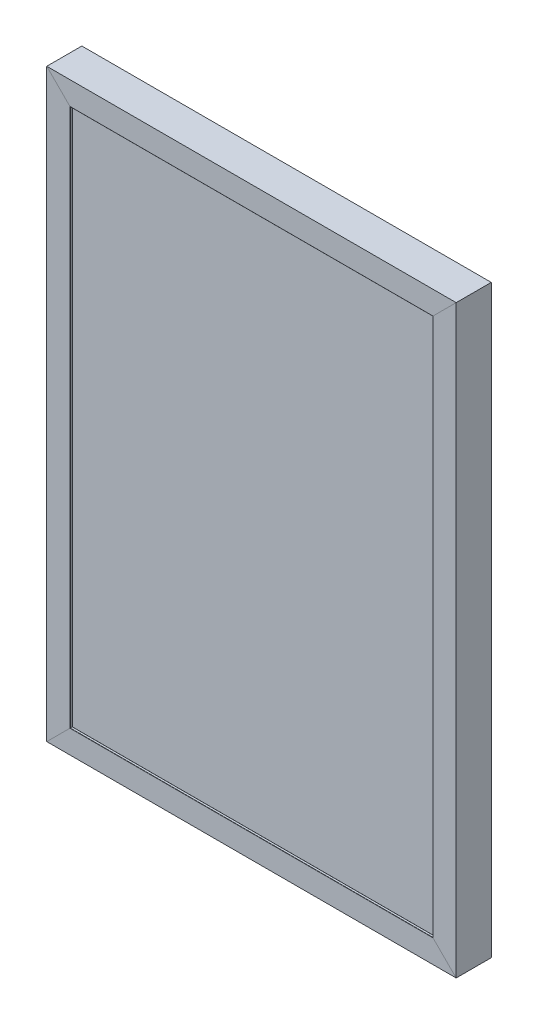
ISO-10303-21;
HEADER;
FILE_DESCRIPTION(('STEP AP214'),'2;1');
FILE_NAME('part.step','',(''),(''),'','','');
FILE_SCHEMA(('AUTOMOTIVE_DESIGN { 1 0 10303 214 1 1 1 1 }'));
ENDSEC;
DATA;
#1=APPLICATION_CONTEXT('core data for automotive mechanical design processes');
#2=APPLICATION_PROTOCOL_DEFINITION('international standard','automotive_design',2000,#1);
#3=PRODUCT_CONTEXT('',#1,'mechanical');
#4=PRODUCT('Part','Part','',(#3));
#5=PRODUCT_RELATED_PRODUCT_CATEGORY('part','',(#4));
#6=PRODUCT_DEFINITION_FORMATION('','',#4);
#7=PRODUCT_DEFINITION_CONTEXT('part definition',#1,'design');
#8=PRODUCT_DEFINITION('design','',#6,#7);
#9=PRODUCT_DEFINITION_SHAPE('','',#8);
#10=(LENGTH_UNIT() NAMED_UNIT(*) SI_UNIT(.MILLI.,.METRE.));
#11=(NAMED_UNIT(*) PLANE_ANGLE_UNIT() SI_UNIT($,.RADIAN.));
#12=(NAMED_UNIT(*) SI_UNIT($,.STERADIAN.) SOLID_ANGLE_UNIT());
#13=UNCERTAINTY_MEASURE_WITH_UNIT(LENGTH_MEASURE(1.E-05),#10,'distance_accuracy_value','');
#14=(GEOMETRIC_REPRESENTATION_CONTEXT(3) GLOBAL_UNCERTAINTY_ASSIGNED_CONTEXT((#13)) GLOBAL_UNIT_ASSIGNED_CONTEXT((#10,
#11,#12)) REPRESENTATION_CONTEXT('',''));
#15=CARTESIAN_POINT('',(0.,0.,0.));
#16=DIRECTION('',(0.,0.,1.));
#17=DIRECTION('',(1.,0.,0.));
#18=AXIS2_PLACEMENT_3D('',#15,#16,#17);
#19=CARTESIAN_POINT('',(-345.,-495.,-16.));
#20=DIRECTION('',(0.,1.,0.));
#21=DIRECTION('',(0.,0.,1.));
#22=AXIS2_PLACEMENT_3D('',#19,#20,#21);
#23=PLANE('',#22);
#24=DIRECTION('',(-1.,0.,0.));
#25=VECTOR('',#24,1.);
#26=CARTESIAN_POINT('',(-345.,-495.,16.));
#27=LINE('',#26,#25);
#28=CARTESIAN_POINT('',(345.,-495.,16.));
#29=VERTEX_POINT('',#28);
#30=CARTESIAN_POINT('',(-345.,-495.,16.));
#31=VERTEX_POINT('',#30);
#32=EDGE_CURVE('E111',#29,#31,#27,.T.);
#33=ORIENTED_EDGE('',*,*,#32,.T.);
#34=DIRECTION('',(0.,0.,1.));
#35=VECTOR('',#34,1.);
#36=CARTESIAN_POINT('',(-345.,-495.,-16.));
#37=LINE('',#36,#35);
#38=CARTESIAN_POINT('',(-345.,-495.,-16.));
#39=VERTEX_POINT('',#38);
#40=EDGE_CURVE('E12',#39,#31,#37,.T.);
#41=ORIENTED_EDGE('',*,*,#40,.F.);
#42=DIRECTION('',(-1.,0.,0.));
#43=VECTOR('',#42,1.);
#44=CARTESIAN_POINT('',(-345.,-495.,-16.));
#45=LINE('',#44,#43);
#46=CARTESIAN_POINT('',(345.,-495.,-16.));
#47=VERTEX_POINT('',#46);
#48=EDGE_CURVE('E99',#47,#39,#45,.T.);
#49=ORIENTED_EDGE('',*,*,#48,.F.);
#50=DIRECTION('',(0.,0.,1.));
#51=VECTOR('',#50,1.);
#52=CARTESIAN_POINT('',(345.,-495.,-16.));
#53=LINE('',#52,#51);
#54=EDGE_CURVE('E107',#47,#29,#53,.T.);
#55=ORIENTED_EDGE('',*,*,#54,.T.);
#56=EDGE_LOOP('',(#33,#41,#49,#55));
#57=FACE_BOUND('',#56,.T.);
#58=ADVANCED_FACE('F48',(#57),#23,.F.);
#59=CARTESIAN_POINT('',(-345.,-495.,-16.));
#60=DIRECTION('',(1.,0.,0.));
#61=DIRECTION('',(0.,0.,-1.));
#62=AXIS2_PLACEMENT_3D('',#59,#60,#61);
#63=PLANE('',#62);
#64=DIRECTION('',(0.,1.,0.));
#65=VECTOR('',#64,1.);
#66=CARTESIAN_POINT('',(-345.,-495.,16.));
#67=LINE('',#66,#65);
#68=CARTESIAN_POINT('',(-345.,495.,16.));
#69=VERTEX_POINT('',#68);
#70=EDGE_CURVE('E103',#31,#69,#67,.T.);
#71=ORIENTED_EDGE('',*,*,#70,.T.);
#72=DIRECTION('',(0.,0.,1.));
#73=VECTOR('',#72,1.);
#74=CARTESIAN_POINT('',(-345.,495.,-16.));
#75=LINE('',#74,#73);
#76=CARTESIAN_POINT('',(-345.,495.,-16.));
#77=VERTEX_POINT('',#76);
#78=EDGE_CURVE('E56',#77,#69,#75,.T.);
#79=ORIENTED_EDGE('',*,*,#78,.F.);
#80=DIRECTION('',(0.,1.,0.));
#81=VECTOR('',#80,1.);
#82=CARTESIAN_POINT('',(-345.,-495.,-16.));
#83=LINE('',#82,#81);
#84=EDGE_CURVE('E94',#39,#77,#83,.T.);
#85=ORIENTED_EDGE('',*,*,#84,.F.);
#86=ORIENTED_EDGE('',*,*,#40,.T.);
#87=EDGE_LOOP('',(#71,#79,#85,#86));
#88=FACE_BOUND('',#87,.T.);
#89=ADVANCED_FACE('F102',(#88),#63,.F.);
#90=CARTESIAN_POINT('',(-345.,495.,-16.));
#91=DIRECTION('',(0.,-1.,0.));
#92=DIRECTION('',(0.,0.,-1.));
#93=AXIS2_PLACEMENT_3D('',#90,#91,#92);
#94=PLANE('',#93);
#95=DIRECTION('',(1.,0.,0.));
#96=VECTOR('',#95,1.);
#97=CARTESIAN_POINT('',(-345.,495.,16.));
#98=LINE('',#97,#96);
#99=CARTESIAN_POINT('',(345.,495.,16.));
#100=VERTEX_POINT('',#99);
#101=EDGE_CURVE('E81',#69,#100,#98,.T.);
#102=ORIENTED_EDGE('',*,*,#101,.T.);
#103=DIRECTION('',(0.,0.,1.));
#104=VECTOR('',#103,1.);
#105=CARTESIAN_POINT('',(345.,495.,-16.));
#106=LINE('',#105,#104);
#107=CARTESIAN_POINT('',(345.,495.,-16.));
#108=VERTEX_POINT('',#107);
#109=EDGE_CURVE('E104',#108,#100,#106,.T.);
#110=ORIENTED_EDGE('',*,*,#109,.F.);
#111=DIRECTION('',(1.,0.,0.));
#112=VECTOR('',#111,1.);
#113=CARTESIAN_POINT('',(-345.,495.,-16.));
#114=LINE('',#113,#112);
#115=EDGE_CURVE('E97',#77,#108,#114,.T.);
#116=ORIENTED_EDGE('',*,*,#115,.F.);
#117=ORIENTED_EDGE('',*,*,#78,.T.);
#118=EDGE_LOOP('',(#102,#110,#116,#117));
#119=FACE_BOUND('',#118,.T.);
#120=ADVANCED_FACE('F105',(#119),#94,.F.);
#121=CARTESIAN_POINT('',(345.,-495.,-16.));
#122=DIRECTION('',(-1.,0.,0.));
#123=DIRECTION('',(0.,0.,1.));
#124=AXIS2_PLACEMENT_3D('',#121,#122,#123);
#125=PLANE('',#124);
#126=DIRECTION('',(0.,-1.,0.));
#127=VECTOR('',#126,1.);
#128=CARTESIAN_POINT('',(345.,-495.,16.));
#129=LINE('',#128,#127);
#130=EDGE_CURVE('E87',#100,#29,#129,.T.);
#131=ORIENTED_EDGE('',*,*,#130,.T.);
#132=ORIENTED_EDGE('',*,*,#54,.F.);
#133=DIRECTION('',(0.,-1.,0.));
#134=VECTOR('',#133,1.);
#135=CARTESIAN_POINT('',(345.,-495.,-16.));
#136=LINE('',#135,#134);
#137=EDGE_CURVE('E64',#108,#47,#136,.T.);
#138=ORIENTED_EDGE('',*,*,#137,.F.);
#139=ORIENTED_EDGE('',*,*,#109,.T.);
#140=EDGE_LOOP('',(#131,#132,#138,#139));
#141=FACE_BOUND('',#140,.T.);
#142=ADVANCED_FACE('F118',(#141),#125,.F.);
#143=CARTESIAN_POINT('',(345.,-495.,-16.));
#144=DIRECTION('',(0.,0.,1.));
#145=DIRECTION('',(1.,0.,0.));
#146=AXIS2_PLACEMENT_3D('',#143,#144,#145);
#147=PLANE('',#146);
#148=ORIENTED_EDGE('',*,*,#48,.T.);
#149=ORIENTED_EDGE('',*,*,#84,.T.);
#150=ORIENTED_EDGE('',*,*,#115,.T.);
#151=ORIENTED_EDGE('',*,*,#137,.T.);
#152=EDGE_LOOP('',(#148,#149,#150,#151));
#153=FACE_BOUND('',#152,.T.);
#154=ADVANCED_FACE('F95',(#153),#147,.F.);
#155=CARTESIAN_POINT('',(345.,-495.,16.));
#156=DIRECTION('',(0.,0.,1.));
#157=DIRECTION('',(1.,0.,0.));
#158=AXIS2_PLACEMENT_3D('',#155,#156,#157);
#159=PLANE('',#158);
#160=ORIENTED_EDGE('',*,*,#32,.F.);
#161=ORIENTED_EDGE('',*,*,#130,.F.);
#162=ORIENTED_EDGE('',*,*,#101,.F.);
#163=ORIENTED_EDGE('',*,*,#70,.F.);
#164=EDGE_LOOP('',(#160,#161,#162,#163));
#165=FACE_BOUND('',#164,.T.);
#166=ADVANCED_FACE('F121',(#165),#159,.T.);
#167=CLOSED_SHELL('',(#58,#89,#120,#142,#154,#166));
#168=MANIFOLD_SOLID_BREP('B2',#167);
#169=CARTESIAN_POINT('',(350.,-460.,29.6));
#170=DIRECTION('',(0.,-1.,0.));
#171=DIRECTION('',(0.,0.,-1.));
#172=AXIS2_PLACEMENT_3D('',#169,#170,#171);
#173=PLANE('',#172);
#174=DIRECTION('',(0.,0.,1.));
#175=VECTOR('',#174,1.);
#176=CARTESIAN_POINT('',(310.,-460.,29.6));
#177=LINE('',#176,#175);
#178=CARTESIAN_POINT('',(310.,-460.,26.4));
#179=VERTEX_POINT('',#178);
#180=CARTESIAN_POINT('',(310.,-460.,29.6));
#181=VERTEX_POINT('',#180);
#182=EDGE_CURVE('E295',#179,#181,#177,.T.);
#183=ORIENTED_EDGE('',*,*,#182,.F.);
#184=DIRECTION('',(-1.,0.,0.));
#185=VECTOR('',#184,1.);
#186=CARTESIAN_POINT('',(350.,-460.,26.4));
#187=LINE('',#186,#185);
#188=CARTESIAN_POINT('',(-310.,-460.,26.4));
#189=VERTEX_POINT('',#188);
#190=EDGE_CURVE('E375',#179,#189,#187,.T.);
#191=ORIENTED_EDGE('',*,*,#190,.T.);
#192=DIRECTION('',(0.,0.,1.));
#193=VECTOR('',#192,1.);
#194=CARTESIAN_POINT('',(-310.,-460.,29.6));
#195=LINE('',#194,#193);
#196=CARTESIAN_POINT('',(-310.,-460.,29.6));
#197=VERTEX_POINT('',#196);
#198=EDGE_CURVE('E298',#189,#197,#195,.T.);
#199=ORIENTED_EDGE('',*,*,#198,.T.);
#200=DIRECTION('',(-1.,0.,0.));
#201=VECTOR('',#200,1.);
#202=CARTESIAN_POINT('',(350.,-460.,29.6));
#203=LINE('',#202,#201);
#204=EDGE_CURVE('E198',#181,#197,#203,.T.);
#205=ORIENTED_EDGE('',*,*,#204,.F.);
#206=EDGE_LOOP('',(#183,#191,#199,#205));
#207=FACE_BOUND('',#206,.T.);
#208=ADVANCED_FACE('F194',(#207),#173,.F.);
#209=CARTESIAN_POINT('',(350.,-460.4,26.4));
#210=DIRECTION('',(-1.,0.,0.));
#211=DIRECTION('',(0.,0.,1.));
#212=AXIS2_PLACEMENT_3D('',#209,#210,#211);
#213=CYLINDRICAL_SURFACE('',#212,0.400000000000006);
#214=CARTESIAN_POINT('',(310.4,-460.4,26.4));
#215=DIRECTION('',(0.707106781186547,0.707106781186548,0.));
#216=DIRECTION('',(-0.707106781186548,0.707106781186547,0.));
#217=AXIS2_PLACEMENT_3D('',#214,#215,#216);
#218=ELLIPSE('',#217,0.565685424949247,0.400000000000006);
#219=CARTESIAN_POINT('',(310.4,-460.4,26.));
#220=VERTEX_POINT('',#219);
#221=EDGE_CURVE('E309',#220,#179,#218,.T.);
#222=ORIENTED_EDGE('',*,*,#221,.F.);
#223=DIRECTION('',(-1.,0.,0.));
#224=VECTOR('',#223,1.);
#225=CARTESIAN_POINT('',(350.,-460.4,26.));
#226=LINE('',#225,#224);
#227=CARTESIAN_POINT('',(-310.4,-460.4,26.));
#228=VERTEX_POINT('',#227);
#229=EDGE_CURVE('E374',#220,#228,#226,.T.);
#230=ORIENTED_EDGE('',*,*,#229,.T.);
#231=CARTESIAN_POINT('',(-310.4,-460.4,26.4));
#232=DIRECTION('',(0.707106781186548,-0.707106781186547,0.));
#233=DIRECTION('',(-0.707106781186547,-0.707106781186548,0.));
#234=AXIS2_PLACEMENT_3D('',#231,#232,#233);
#235=ELLIPSE('',#234,0.565685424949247,0.400000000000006);
#236=EDGE_CURVE('E313',#228,#189,#235,.T.);
#237=ORIENTED_EDGE('',*,*,#236,.T.);
#238=ORIENTED_EDGE('',*,*,#190,.F.);
#239=EDGE_LOOP('',(#222,#230,#237,#238));
#240=FACE_BOUND('',#239,.T.);
#241=ADVANCED_FACE('F448',(#240),#213,.T.);
#242=CARTESIAN_POINT('',(350.,-460.4,26.));
#243=DIRECTION('',(0.,0.,1.));
#244=DIRECTION('',(1.,0.,0.));
#245=AXIS2_PLACEMENT_3D('',#242,#243,#244);
#246=PLANE('',#245);
#247=DIRECTION('',(-0.707106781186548,0.707106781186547,0.));
#248=VECTOR('',#247,1.);
#249=CARTESIAN_POINT('',(330.2,-480.2,26.));
#250=LINE('',#249,#248);
#251=CARTESIAN_POINT('',(343.5,-493.5,26.));
#252=VERTEX_POINT('',#251);
#253=EDGE_CURVE('E46',#252,#220,#250,.T.);
#254=ORIENTED_EDGE('',*,*,#253,.F.);
#255=DIRECTION('',(-1.,0.,0.));
#256=VECTOR('',#255,1.);
#257=CARTESIAN_POINT('',(350.,-493.5,26.));
#258=LINE('',#257,#256);
#259=CARTESIAN_POINT('',(-343.5,-493.5,26.));
#260=VERTEX_POINT('',#259);
#261=EDGE_CURVE('E372',#252,#260,#258,.T.);
#262=ORIENTED_EDGE('',*,*,#261,.T.);
#263=DIRECTION('',(0.707106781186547,0.707106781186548,0.));
#264=VECTOR('',#263,1.);
#265=CARTESIAN_POINT('',(19.8,-130.2,26.));
#266=LINE('',#265,#264);
#267=EDGE_CURVE('E371',#260,#228,#266,.T.);
#268=ORIENTED_EDGE('',*,*,#267,.T.);
#269=ORIENTED_EDGE('',*,*,#229,.F.);
#270=EDGE_LOOP('',(#254,#262,#268,#269));
#271=FACE_BOUND('',#270,.T.);
#272=ADVANCED_FACE('F402',(#271),#246,.F.);
#273=CARTESIAN_POINT('',(350.,-493.5,23.5));
#274=DIRECTION('',(-1.,0.,0.));
#275=DIRECTION('',(0.,0.,1.));
#276=AXIS2_PLACEMENT_3D('',#273,#274,#275);
#277=CYLINDRICAL_SURFACE('',#276,2.5);
#278=CARTESIAN_POINT('',(343.5,-493.5,23.5));
#279=DIRECTION('',(0.707106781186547,0.707106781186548,0.));
#280=DIRECTION('',(-0.707106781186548,0.707106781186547,0.));
#281=AXIS2_PLACEMENT_3D('',#278,#279,#280);
#282=ELLIPSE('',#281,3.53553390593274,2.5);
#283=CARTESIAN_POINT('',(346.,-496.,23.5));
#284=VERTEX_POINT('',#283);
#285=EDGE_CURVE('E203',#284,#252,#282,.F.);
#286=ORIENTED_EDGE('',*,*,#285,.F.);
#287=DIRECTION('',(-1.,0.,0.));
#288=VECTOR('',#287,1.);
#289=CARTESIAN_POINT('',(350.,-496.,23.5));
#290=LINE('',#289,#288);
#291=CARTESIAN_POINT('',(-346.,-496.,23.5));
#292=VERTEX_POINT('',#291);
#293=EDGE_CURVE('E369',#284,#292,#290,.T.);
#294=ORIENTED_EDGE('',*,*,#293,.T.);
#295=CARTESIAN_POINT('',(-343.5,-493.5,23.5));
#296=DIRECTION('',(0.707106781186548,-0.707106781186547,0.));
#297=DIRECTION('',(-0.707106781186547,-0.707106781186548,0.));
#298=AXIS2_PLACEMENT_3D('',#295,#296,#297);
#299=ELLIPSE('',#298,3.53553390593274,2.5);
#300=EDGE_CURVE('E368',#292,#260,#299,.F.);
#301=ORIENTED_EDGE('',*,*,#300,.T.);
#302=ORIENTED_EDGE('',*,*,#261,.F.);
#303=EDGE_LOOP('',(#286,#294,#301,#302));
#304=FACE_BOUND('',#303,.T.);
#305=ADVANCED_FACE('F411',(#304),#277,.F.);
#306=CARTESIAN_POINT('',(350.,-496.,-23.5));
#307=DIRECTION('',(0.,-1.,0.));
#308=DIRECTION('',(0.,0.,-1.));
#309=AXIS2_PLACEMENT_3D('',#306,#307,#308);
#310=PLANE('',#309);
#311=DIRECTION('',(0.,0.,1.));
#312=VECTOR('',#311,1.);
#313=CARTESIAN_POINT('',(346.,-496.,-23.5));
#314=LINE('',#313,#312);
#315=CARTESIAN_POINT('',(346.,-496.,-23.5));
#316=VERTEX_POINT('',#315);
#317=EDGE_CURVE('E318',#316,#284,#314,.T.);
#318=ORIENTED_EDGE('',*,*,#317,.F.);
#319=DIRECTION('',(-1.,0.,0.));
#320=VECTOR('',#319,1.);
#321=CARTESIAN_POINT('',(350.,-496.,-23.5));
#322=LINE('',#321,#320);
#323=CARTESIAN_POINT('',(-346.,-496.,-23.5));
#324=VERTEX_POINT('',#323);
#325=EDGE_CURVE('E366',#316,#324,#322,.T.);
#326=ORIENTED_EDGE('',*,*,#325,.T.);
#327=DIRECTION('',(0.,0.,1.));
#328=VECTOR('',#327,1.);
#329=CARTESIAN_POINT('',(-346.,-496.,-23.5));
#330=LINE('',#329,#328);
#331=EDGE_CURVE('E365',#324,#292,#330,.T.);
#332=ORIENTED_EDGE('',*,*,#331,.T.);
#333=ORIENTED_EDGE('',*,*,#293,.F.);
#334=EDGE_LOOP('',(#318,#326,#332,#333));
#335=FACE_BOUND('',#334,.T.);
#336=ADVANCED_FACE('F414',(#335),#310,.F.);
#337=CARTESIAN_POINT('',(350.,-493.5,-23.5));
#338=DIRECTION('',(-1.,0.,0.));
#339=DIRECTION('',(0.,0.,1.));
#340=AXIS2_PLACEMENT_3D('',#337,#338,#339);
#341=CYLINDRICAL_SURFACE('',#340,2.5);
#342=CARTESIAN_POINT('',(343.5,-493.5,-23.5));
#343=DIRECTION('',(0.707106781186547,0.707106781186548,0.));
#344=DIRECTION('',(-0.707106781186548,0.707106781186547,0.));
#345=AXIS2_PLACEMENT_3D('',#342,#343,#344);
#346=ELLIPSE('',#345,3.53553390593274,2.5);
#347=CARTESIAN_POINT('',(343.5,-493.5,-26.));
#348=VERTEX_POINT('',#347);
#349=EDGE_CURVE('E321',#348,#316,#346,.F.);
#350=ORIENTED_EDGE('',*,*,#349,.F.);
#351=DIRECTION('',(-1.,0.,0.));
#352=VECTOR('',#351,1.);
#353=CARTESIAN_POINT('',(350.,-493.5,-26.));
#354=LINE('',#353,#352);
#355=CARTESIAN_POINT('',(-343.5,-493.5,-26.));
#356=VERTEX_POINT('',#355);
#357=EDGE_CURVE('E363',#348,#356,#354,.T.);
#358=ORIENTED_EDGE('',*,*,#357,.T.);
#359=CARTESIAN_POINT('',(-343.5,-493.5,-23.5));
#360=DIRECTION('',(0.707106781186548,-0.707106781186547,0.));
#361=DIRECTION('',(-0.707106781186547,-0.707106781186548,0.));
#362=AXIS2_PLACEMENT_3D('',#359,#360,#361);
#363=ELLIPSE('',#362,3.53553390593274,2.5);
#364=EDGE_CURVE('E362',#356,#324,#363,.F.);
#365=ORIENTED_EDGE('',*,*,#364,.T.);
#366=ORIENTED_EDGE('',*,*,#325,.F.);
#367=EDGE_LOOP('',(#350,#358,#365,#366));
#368=FACE_BOUND('',#367,.T.);
#369=ADVANCED_FACE('F418',(#368),#341,.F.);
#370=CARTESIAN_POINT('',(350.,-460.4,-26.));
#371=DIRECTION('',(0.,0.,-1.));
#372=DIRECTION('',(-1.,0.,0.));
#373=AXIS2_PLACEMENT_3D('',#370,#371,#372);
#374=PLANE('',#373);
#375=DIRECTION('',(0.707106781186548,-0.707106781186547,0.));
#376=VECTOR('',#375,1.);
#377=CARTESIAN_POINT('',(330.2,-480.2,-26.));
#378=LINE('',#377,#376);
#379=CARTESIAN_POINT('',(310.4,-460.4,-26.));
#380=VERTEX_POINT('',#379);
#381=EDGE_CURVE('E324',#380,#348,#378,.T.);
#382=ORIENTED_EDGE('',*,*,#381,.F.);
#383=DIRECTION('',(-1.,0.,0.));
#384=VECTOR('',#383,1.);
#385=CARTESIAN_POINT('',(350.,-460.4,-26.));
#386=LINE('',#385,#384);
#387=CARTESIAN_POINT('',(-310.4,-460.4,-26.));
#388=VERTEX_POINT('',#387);
#389=EDGE_CURVE('E360',#380,#388,#386,.T.);
#390=ORIENTED_EDGE('',*,*,#389,.T.);
#391=DIRECTION('',(-0.707106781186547,-0.707106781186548,0.));
#392=VECTOR('',#391,1.);
#393=CARTESIAN_POINT('',(19.8,-130.2,-26.));
#394=LINE('',#393,#392);
#395=EDGE_CURVE('E359',#388,#356,#394,.T.);
#396=ORIENTED_EDGE('',*,*,#395,.T.);
#397=ORIENTED_EDGE('',*,*,#357,.F.);
#398=EDGE_LOOP('',(#382,#390,#396,#397));
#399=FACE_BOUND('',#398,.T.);
#400=ADVANCED_FACE('F421',(#399),#374,.F.);
#401=CARTESIAN_POINT('',(350.,-460.4,-26.4));
#402=DIRECTION('',(-1.,0.,0.));
#403=DIRECTION('',(0.,0.,1.));
#404=AXIS2_PLACEMENT_3D('',#401,#402,#403);
#405=CYLINDRICAL_SURFACE('',#404,0.400000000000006);
#406=CARTESIAN_POINT('',(310.4,-460.4,-26.4));
#407=DIRECTION('',(0.707106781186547,0.707106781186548,0.));
#408=DIRECTION('',(-0.707106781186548,0.707106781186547,0.));
#409=AXIS2_PLACEMENT_3D('',#406,#407,#408);
#410=ELLIPSE('',#409,0.565685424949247,0.400000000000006);
#411=CARTESIAN_POINT('',(310.,-460.,-26.4));
#412=VERTEX_POINT('',#411);
#413=EDGE_CURVE('E327',#412,#380,#410,.T.);
#414=ORIENTED_EDGE('',*,*,#413,.F.);
#415=DIRECTION('',(-1.,0.,0.));
#416=VECTOR('',#415,1.);
#417=CARTESIAN_POINT('',(350.,-460.,-26.4));
#418=LINE('',#417,#416);
#419=CARTESIAN_POINT('',(-310.,-460.,-26.4));
#420=VERTEX_POINT('',#419);
#421=EDGE_CURVE('E357',#412,#420,#418,.T.);
#422=ORIENTED_EDGE('',*,*,#421,.T.);
#423=CARTESIAN_POINT('',(-310.4,-460.4,-26.4));
#424=DIRECTION('',(0.707106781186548,-0.707106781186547,0.));
#425=DIRECTION('',(-0.707106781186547,-0.707106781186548,0.));
#426=AXIS2_PLACEMENT_3D('',#423,#424,#425);
#427=ELLIPSE('',#426,0.565685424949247,0.400000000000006);
#428=EDGE_CURVE('E356',#420,#388,#427,.T.);
#429=ORIENTED_EDGE('',*,*,#428,.T.);
#430=ORIENTED_EDGE('',*,*,#389,.F.);
#431=EDGE_LOOP('',(#414,#422,#429,#430));
#432=FACE_BOUND('',#431,.T.);
#433=ADVANCED_FACE('F427',(#432),#405,.T.);
#434=CARTESIAN_POINT('',(350.,-460.,-29.6));
#435=DIRECTION('',(0.,-1.,0.));
#436=DIRECTION('',(0.,0.,-1.));
#437=AXIS2_PLACEMENT_3D('',#434,#435,#436);
#438=PLANE('',#437);
#439=DIRECTION('',(0.,0.,1.));
#440=VECTOR('',#439,1.);
#441=CARTESIAN_POINT('',(310.,-460.,-29.6));
#442=LINE('',#441,#440);
#443=CARTESIAN_POINT('',(310.,-460.,-29.6));
#444=VERTEX_POINT('',#443);
#445=EDGE_CURVE('E330',#444,#412,#442,.T.);
#446=ORIENTED_EDGE('',*,*,#445,.F.);
#447=DIRECTION('',(-1.,0.,0.));
#448=VECTOR('',#447,1.);
#449=CARTESIAN_POINT('',(350.,-460.,-29.6));
#450=LINE('',#449,#448);
#451=CARTESIAN_POINT('',(-310.,-460.,-29.6));
#452=VERTEX_POINT('',#451);
#453=EDGE_CURVE('E354',#444,#452,#450,.T.);
#454=ORIENTED_EDGE('',*,*,#453,.T.);
#455=DIRECTION('',(0.,0.,1.));
#456=VECTOR('',#455,1.);
#457=CARTESIAN_POINT('',(-310.,-460.,-29.6));
#458=LINE('',#457,#456);
#459=EDGE_CURVE('E353',#452,#420,#458,.T.);
#460=ORIENTED_EDGE('',*,*,#459,.T.);
#461=ORIENTED_EDGE('',*,*,#421,.F.);
#462=EDGE_LOOP('',(#446,#454,#460,#461));
#463=FACE_BOUND('',#462,.T.);
#464=ADVANCED_FACE('F430',(#463),#438,.F.);
#465=CARTESIAN_POINT('',(350.,-460.4,-29.6));
#466=DIRECTION('',(-1.,0.,0.));
#467=DIRECTION('',(0.,0.,1.));
#468=AXIS2_PLACEMENT_3D('',#465,#466,#467);
#469=CYLINDRICAL_SURFACE('',#468,0.400000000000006);
#470=CARTESIAN_POINT('',(310.4,-460.4,-29.6));
#471=DIRECTION('',(0.707106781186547,0.707106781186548,0.));
#472=DIRECTION('',(-0.707106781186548,0.707106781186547,0.));
#473=AXIS2_PLACEMENT_3D('',#470,#471,#472);
#474=ELLIPSE('',#473,0.565685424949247,0.400000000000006);
#475=CARTESIAN_POINT('',(310.4,-460.4,-30.));
#476=VERTEX_POINT('',#475);
#477=EDGE_CURVE('E333',#476,#444,#474,.T.);
#478=ORIENTED_EDGE('',*,*,#477,.F.);
#479=DIRECTION('',(-1.,0.,0.));
#480=VECTOR('',#479,1.);
#481=CARTESIAN_POINT('',(350.,-460.4,-30.));
#482=LINE('',#481,#480);
#483=CARTESIAN_POINT('',(-310.4,-460.4,-30.));
#484=VERTEX_POINT('',#483);
#485=EDGE_CURVE('E351',#476,#484,#482,.T.);
#486=ORIENTED_EDGE('',*,*,#485,.T.);
#487=CARTESIAN_POINT('',(-310.4,-460.4,-29.6));
#488=DIRECTION('',(0.707106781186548,-0.707106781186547,0.));
#489=DIRECTION('',(-0.707106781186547,-0.707106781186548,0.));
#490=AXIS2_PLACEMENT_3D('',#487,#488,#489);
#491=ELLIPSE('',#490,0.565685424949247,0.400000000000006);
#492=EDGE_CURVE('E350',#484,#452,#491,.T.);
#493=ORIENTED_EDGE('',*,*,#492,.T.);
#494=ORIENTED_EDGE('',*,*,#453,.F.);
#495=EDGE_LOOP('',(#478,#486,#493,#494));
#496=FACE_BOUND('',#495,.T.);
#497=ADVANCED_FACE('F434',(#496),#469,.T.);
#498=CARTESIAN_POINT('',(350.,-500.,-30.));
#499=DIRECTION('',(0.,0.,1.));
#500=DIRECTION('',(1.,0.,0.));
#501=AXIS2_PLACEMENT_3D('',#498,#499,#500);
#502=PLANE('',#501);
#503=DIRECTION('',(-0.707106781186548,0.707106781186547,0.));
#504=VECTOR('',#503,1.);
#505=CARTESIAN_POINT('',(350.,-500.,-30.));
#506=LINE('',#505,#504);
#507=CARTESIAN_POINT('',(350.,-500.,-30.));
#508=VERTEX_POINT('',#507);
#509=EDGE_CURVE('E336',#508,#476,#506,.T.);
#510=ORIENTED_EDGE('',*,*,#509,.F.);
#511=DIRECTION('',(-1.,0.,0.));
#512=VECTOR('',#511,1.);
#513=CARTESIAN_POINT('',(350.,-500.,-30.));
#514=LINE('',#513,#512);
#515=CARTESIAN_POINT('',(-350.,-500.,-30.));
#516=VERTEX_POINT('',#515);
#517=EDGE_CURVE('E348',#508,#516,#514,.T.);
#518=ORIENTED_EDGE('',*,*,#517,.T.);
#519=DIRECTION('',(0.707106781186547,0.707106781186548,0.));
#520=VECTOR('',#519,1.);
#521=CARTESIAN_POINT('',(0.,-150.,-30.));
#522=LINE('',#521,#520);
#523=EDGE_CURVE('E347',#516,#484,#522,.T.);
#524=ORIENTED_EDGE('',*,*,#523,.T.);
#525=ORIENTED_EDGE('',*,*,#485,.F.);
#526=EDGE_LOOP('',(#510,#518,#524,#525));
#527=FACE_BOUND('',#526,.T.);
#528=ADVANCED_FACE('F437',(#527),#502,.F.);
#529=CARTESIAN_POINT('',(350.,-500.,30.));
#530=DIRECTION('',(0.,1.,0.));
#531=DIRECTION('',(0.,0.,1.));
#532=AXIS2_PLACEMENT_3D('',#529,#530,#531);
#533=PLANE('',#532);
#534=DIRECTION('',(0.,0.,-1.));
#535=VECTOR('',#534,1.);
#536=CARTESIAN_POINT('',(350.,-500.,30.));
#537=LINE('',#536,#535);
#538=CARTESIAN_POINT('',(350.,-500.,30.));
#539=VERTEX_POINT('',#538);
#540=EDGE_CURVE('E339',#539,#508,#537,.T.);
#541=ORIENTED_EDGE('',*,*,#540,.F.);
#542=DIRECTION('',(-1.,0.,0.));
#543=VECTOR('',#542,1.);
#544=CARTESIAN_POINT('',(350.,-500.,30.));
#545=LINE('',#544,#543);
#546=CARTESIAN_POINT('',(-350.,-500.,30.));
#547=VERTEX_POINT('',#546);
#548=EDGE_CURVE('E345',#539,#547,#545,.T.);
#549=ORIENTED_EDGE('',*,*,#548,.T.);
#550=DIRECTION('',(0.,0.,-1.));
#551=VECTOR('',#550,1.);
#552=CARTESIAN_POINT('',(-350.,-500.,30.));
#553=LINE('',#552,#551);
#554=EDGE_CURVE('E344',#547,#516,#553,.T.);
#555=ORIENTED_EDGE('',*,*,#554,.T.);
#556=ORIENTED_EDGE('',*,*,#517,.F.);
#557=EDGE_LOOP('',(#541,#549,#555,#556));
#558=FACE_BOUND('',#557,.T.);
#559=ADVANCED_FACE('F443',(#558),#533,.F.);
#560=CARTESIAN_POINT('',(350.,-500.,30.));
#561=DIRECTION('',(0.,0.,-1.));
#562=DIRECTION('',(-1.,0.,0.));
#563=AXIS2_PLACEMENT_3D('',#560,#561,#562);
#564=PLANE('',#563);
#565=DIRECTION('',(0.707106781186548,-0.707106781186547,0.));
#566=VECTOR('',#565,1.);
#567=CARTESIAN_POINT('',(350.,-500.,30.));
#568=LINE('',#567,#566);
#569=CARTESIAN_POINT('',(310.4,-460.4,30.));
#570=VERTEX_POINT('',#569);
#571=EDGE_CURVE('E306',#570,#539,#568,.T.);
#572=ORIENTED_EDGE('',*,*,#571,.F.);
#573=DIRECTION('',(-1.,0.,0.));
#574=VECTOR('',#573,1.);
#575=CARTESIAN_POINT('',(350.,-460.4,30.));
#576=LINE('',#575,#574);
#577=CARTESIAN_POINT('',(-310.4,-460.4,30.));
#578=VERTEX_POINT('',#577);
#579=EDGE_CURVE('E211',#570,#578,#576,.T.);
#580=ORIENTED_EDGE('',*,*,#579,.T.);
#581=DIRECTION('',(-0.707106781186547,-0.707106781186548,0.));
#582=VECTOR('',#581,1.);
#583=CARTESIAN_POINT('',(0.,-150.,30.));
#584=LINE('',#583,#582);
#585=EDGE_CURVE('E300',#578,#547,#584,.T.);
#586=ORIENTED_EDGE('',*,*,#585,.T.);
#587=ORIENTED_EDGE('',*,*,#548,.F.);
#588=EDGE_LOOP('',(#572,#580,#586,#587));
#589=FACE_BOUND('',#588,.T.);
#590=ADVANCED_FACE('F446',(#589),#564,.F.);
#591=CARTESIAN_POINT('',(350.,-460.4,29.6));
#592=DIRECTION('',(-1.,0.,0.));
#593=DIRECTION('',(0.,0.,1.));
#594=AXIS2_PLACEMENT_3D('',#591,#592,#593);
#595=CYLINDRICAL_SURFACE('',#594,0.400000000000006);
#596=CARTESIAN_POINT('',(310.4,-460.4,29.6));
#597=DIRECTION('',(0.707106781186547,0.707106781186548,0.));
#598=DIRECTION('',(-0.707106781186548,0.707106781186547,0.));
#599=AXIS2_PLACEMENT_3D('',#596,#597,#598);
#600=ELLIPSE('',#599,0.565685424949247,0.400000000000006);
#601=EDGE_CURVE('E302',#181,#570,#600,.T.);
#602=ORIENTED_EDGE('',*,*,#601,.F.);
#603=ORIENTED_EDGE('',*,*,#204,.T.);
#604=CARTESIAN_POINT('',(-310.4,-460.4,29.6));
#605=DIRECTION('',(0.707106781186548,-0.707106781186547,0.));
#606=DIRECTION('',(-0.707106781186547,-0.707106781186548,0.));
#607=AXIS2_PLACEMENT_3D('',#604,#605,#606);
#608=ELLIPSE('',#607,0.565685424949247,0.400000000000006);
#609=EDGE_CURVE('E299',#197,#578,#608,.T.);
#610=ORIENTED_EDGE('',*,*,#609,.T.);
#611=ORIENTED_EDGE('',*,*,#579,.F.);
#612=EDGE_LOOP('',(#602,#603,#610,#611));
#613=FACE_BOUND('',#612,.T.);
#614=ADVANCED_FACE('F303',(#613),#595,.T.);
#615=CARTESIAN_POINT('',(-350.,-500.,0.));
#616=DIRECTION('',(0.707106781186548,-0.707106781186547,0.));
#617=DIRECTION('',(0.707106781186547,0.707106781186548,0.));
#618=AXIS2_PLACEMENT_3D('',#615,#616,#617);
#619=PLANE('',#618);
#620=ORIENTED_EDGE('',*,*,#198,.F.);
#621=ORIENTED_EDGE('',*,*,#236,.F.);
#622=ORIENTED_EDGE('',*,*,#267,.F.);
#623=ORIENTED_EDGE('',*,*,#300,.F.);
#624=ORIENTED_EDGE('',*,*,#331,.F.);
#625=ORIENTED_EDGE('',*,*,#364,.F.);
#626=ORIENTED_EDGE('',*,*,#395,.F.);
#627=ORIENTED_EDGE('',*,*,#428,.F.);
#628=ORIENTED_EDGE('',*,*,#459,.F.);
#629=ORIENTED_EDGE('',*,*,#492,.F.);
#630=ORIENTED_EDGE('',*,*,#523,.F.);
#631=ORIENTED_EDGE('',*,*,#554,.F.);
#632=ORIENTED_EDGE('',*,*,#585,.F.);
#633=ORIENTED_EDGE('',*,*,#609,.F.);
#634=EDGE_LOOP('',(#620,#621,#622,#623,#624,#625,#626,#627,#628,#629,#630,#631,#632,#633));
#635=FACE_BOUND('',#634,.T.);
#636=ADVANCED_FACE('F407',(#635),#619,.F.);
#637=CARTESIAN_POINT('',(350.,-500.,0.));
#638=DIRECTION('',(0.707106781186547,0.707106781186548,0.));
#639=DIRECTION('',(-0.707106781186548,0.707106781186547,0.));
#640=AXIS2_PLACEMENT_3D('',#637,#638,#639);
#641=PLANE('',#640);
#642=ORIENTED_EDGE('',*,*,#221,.T.);
#643=ORIENTED_EDGE('',*,*,#182,.T.);
#644=ORIENTED_EDGE('',*,*,#601,.T.);
#645=ORIENTED_EDGE('',*,*,#571,.T.);
#646=ORIENTED_EDGE('',*,*,#540,.T.);
#647=ORIENTED_EDGE('',*,*,#509,.T.);
#648=ORIENTED_EDGE('',*,*,#477,.T.);
#649=ORIENTED_EDGE('',*,*,#445,.T.);
#650=ORIENTED_EDGE('',*,*,#413,.T.);
#651=ORIENTED_EDGE('',*,*,#381,.T.);
#652=ORIENTED_EDGE('',*,*,#349,.T.);
#653=ORIENTED_EDGE('',*,*,#317,.T.);
#654=ORIENTED_EDGE('',*,*,#285,.T.);
#655=ORIENTED_EDGE('',*,*,#253,.T.);
#656=EDGE_LOOP('',(#642,#643,#644,#645,#646,#647,#648,#649,#650,#651,#652,#653,#654,#655));
#657=FACE_BOUND('',#656,.T.);
#658=ADVANCED_FACE('F196',(#657),#641,.T.);
#659=CLOSED_SHELL('',(#208,#241,#272,#305,#336,#369,#400,#433,#464,#497,#528,#559,#590,#614,
#636,#658));
#660=MANIFOLD_SOLID_BREP('B6',#659);
#661=CARTESIAN_POINT('',(350.,500.,0.));
#662=DIRECTION('',(-0.707106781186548,0.707106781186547,0.));
#663=DIRECTION('',(-0.707106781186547,-0.707106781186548,0.));
#664=AXIS2_PLACEMENT_3D('',#661,#662,#663);
#665=PLANE('',#664);
#666=DIRECTION('',(0.,0.,1.));
#667=VECTOR('',#666,1.);
#668=CARTESIAN_POINT('',(310.,460.,29.6));
#669=LINE('',#668,#667);
#670=CARTESIAN_POINT('',(310.,460.,26.4));
#671=VERTEX_POINT('',#670);
#672=CARTESIAN_POINT('',(310.,460.,29.6));
#673=VERTEX_POINT('',#672);
#674=EDGE_CURVE('E723',#671,#673,#669,.T.);
#675=ORIENTED_EDGE('',*,*,#674,.T.);
#676=CARTESIAN_POINT('',(310.4,460.4,29.6));
#677=DIRECTION('',(-0.707106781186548,0.707106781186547,0.));
#678=DIRECTION('',(-0.707106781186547,-0.707106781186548,0.));
#679=AXIS2_PLACEMENT_3D('',#676,#677,#678);
#680=ELLIPSE('',#679,0.565685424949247,0.400000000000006);
#681=CARTESIAN_POINT('',(310.4,460.4,30.));
#682=VERTEX_POINT('',#681);
#683=EDGE_CURVE('E733',#673,#682,#680,.T.);
#684=ORIENTED_EDGE('',*,*,#683,.T.);
#685=DIRECTION('',(0.707106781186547,0.707106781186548,0.));
#686=VECTOR('',#685,1.);
#687=CARTESIAN_POINT('',(350.,500.,30.));
#688=LINE('',#687,#686);
#689=CARTESIAN_POINT('',(350.,500.,30.));
#690=VERTEX_POINT('',#689);
#691=EDGE_CURVE('E770',#682,#690,#688,.T.);
#692=ORIENTED_EDGE('',*,*,#691,.T.);
#693=DIRECTION('',(0.,0.,-1.));
#694=VECTOR('',#693,1.);
#695=CARTESIAN_POINT('',(350.,500.,30.));
#696=LINE('',#695,#694);
#697=CARTESIAN_POINT('',(350.,500.,-30.));
#698=VERTEX_POINT('',#697);
#699=EDGE_CURVE('E767',#690,#698,#696,.T.);
#700=ORIENTED_EDGE('',*,*,#699,.T.);
#701=DIRECTION('',(-0.707106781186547,-0.707106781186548,0.));
#702=VECTOR('',#701,1.);
#703=CARTESIAN_POINT('',(350.,500.,-30.));
#704=LINE('',#703,#702);
#705=CARTESIAN_POINT('',(310.4,460.4,-30.));
#706=VERTEX_POINT('',#705);
#707=EDGE_CURVE('E764',#698,#706,#704,.T.);
#708=ORIENTED_EDGE('',*,*,#707,.T.);
#709=CARTESIAN_POINT('',(310.4,460.4,-29.6));
#710=DIRECTION('',(-0.707106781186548,0.707106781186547,0.));
#711=DIRECTION('',(-0.707106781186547,-0.707106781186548,0.));
#712=AXIS2_PLACEMENT_3D('',#709,#710,#711);
#713=ELLIPSE('',#712,0.565685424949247,0.400000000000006);
#714=CARTESIAN_POINT('',(310.,460.,-29.6));
#715=VERTEX_POINT('',#714);
#716=EDGE_CURVE('E761',#706,#715,#713,.T.);
#717=ORIENTED_EDGE('',*,*,#716,.T.);
#718=DIRECTION('',(0.,0.,1.));
#719=VECTOR('',#718,1.);
#720=CARTESIAN_POINT('',(310.,460.,-29.6));
#721=LINE('',#720,#719);
#722=CARTESIAN_POINT('',(310.,460.,-26.4));
#723=VERTEX_POINT('',#722);
#724=EDGE_CURVE('E758',#715,#723,#721,.T.);
#725=ORIENTED_EDGE('',*,*,#724,.T.);
#726=CARTESIAN_POINT('',(310.4,460.4,-26.4));
#727=DIRECTION('',(-0.707106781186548,0.707106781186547,0.));
#728=DIRECTION('',(-0.707106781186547,-0.707106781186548,0.));
#729=AXIS2_PLACEMENT_3D('',#726,#727,#728);
#730=ELLIPSE('',#729,0.565685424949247,0.400000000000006);
#731=CARTESIAN_POINT('',(310.4,460.4,-26.));
#732=VERTEX_POINT('',#731);
#733=EDGE_CURVE('E755',#723,#732,#730,.T.);
#734=ORIENTED_EDGE('',*,*,#733,.T.);
#735=DIRECTION('',(0.707106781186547,0.707106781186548,0.));
#736=VECTOR('',#735,1.);
#737=CARTESIAN_POINT('',(330.2,480.2,-26.));
#738=LINE('',#737,#736);
#739=CARTESIAN_POINT('',(343.5,493.5,-26.));
#740=VERTEX_POINT('',#739);
#741=EDGE_CURVE('E752',#732,#740,#738,.T.);
#742=ORIENTED_EDGE('',*,*,#741,.T.);
#743=CARTESIAN_POINT('',(343.5,493.5,-23.5));
#744=DIRECTION('',(-0.707106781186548,0.707106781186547,0.));
#745=DIRECTION('',(-0.707106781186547,-0.707106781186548,0.));
#746=AXIS2_PLACEMENT_3D('',#743,#744,#745);
#747=ELLIPSE('',#746,3.53553390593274,2.5);
#748=CARTESIAN_POINT('',(346.,496.,-23.5));
#749=VERTEX_POINT('',#748);
#750=EDGE_CURVE('E749',#740,#749,#747,.F.);
#751=ORIENTED_EDGE('',*,*,#750,.T.);
#752=DIRECTION('',(0.,0.,1.));
#753=VECTOR('',#752,1.);
#754=CARTESIAN_POINT('',(346.,496.,-23.5));
#755=LINE('',#754,#753);
#756=CARTESIAN_POINT('',(346.,496.,23.5));
#757=VERTEX_POINT('',#756);
#758=EDGE_CURVE('E746',#749,#757,#755,.T.);
#759=ORIENTED_EDGE('',*,*,#758,.T.);
#760=CARTESIAN_POINT('',(343.5,493.5,23.5));
#761=DIRECTION('',(-0.707106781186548,0.707106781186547,0.));
#762=DIRECTION('',(-0.707106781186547,-0.707106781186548,0.));
#763=AXIS2_PLACEMENT_3D('',#760,#761,#762);
#764=ELLIPSE('',#763,3.53553390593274,2.5);
#765=CARTESIAN_POINT('',(343.5,493.5,26.));
#766=VERTEX_POINT('',#765);
#767=EDGE_CURVE('E740',#757,#766,#764,.F.);
#768=ORIENTED_EDGE('',*,*,#767,.T.);
#769=DIRECTION('',(-0.707106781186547,-0.707106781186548,0.));
#770=VECTOR('',#769,1.);
#771=CARTESIAN_POINT('',(330.2,480.2,26.));
#772=LINE('',#771,#770);
#773=CARTESIAN_POINT('',(310.4,460.4,26.));
#774=VERTEX_POINT('',#773);
#775=EDGE_CURVE('E737',#766,#774,#772,.T.);
#776=ORIENTED_EDGE('',*,*,#775,.T.);
#777=CARTESIAN_POINT('',(310.4,460.4,26.4));
#778=DIRECTION('',(-0.707106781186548,0.707106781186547,0.));
#779=DIRECTION('',(-0.707106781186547,-0.707106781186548,0.));
#780=AXIS2_PLACEMENT_3D('',#777,#778,#779);
#781=ELLIPSE('',#780,0.565685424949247,0.400000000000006);
#782=EDGE_CURVE('E720',#774,#671,#781,.T.);
#783=ORIENTED_EDGE('',*,*,#782,.T.);
#784=EDGE_LOOP('',(#675,#684,#692,#700,#708,#717,#725,#734,#742,#751,#759,#768,#776,#783));
#785=FACE_BOUND('',#784,.T.);
#786=ADVANCED_FACE('F620',(#785),#665,.T.);
#787=CARTESIAN_POINT('',(310.,500.,29.6));
#788=DIRECTION('',(1.,0.,0.));
#789=DIRECTION('',(0.,1.,0.));
#790=AXIS2_PLACEMENT_3D('',#787,#788,#789);
#791=PLANE('',#790);
#792=DIRECTION('',(0.,-1.,0.));
#793=VECTOR('',#792,1.);
#794=CARTESIAN_POINT('',(310.,500.,26.4));
#795=LINE('',#794,#793);
#796=CARTESIAN_POINT('',(310.,-460.,26.4));
#797=VERTEX_POINT('',#796);
#798=EDGE_CURVE('E716',#671,#797,#795,.T.);
#799=ORIENTED_EDGE('',*,*,#798,.T.);
#800=DIRECTION('',(0.,0.,1.));
#801=VECTOR('',#800,1.);
#802=CARTESIAN_POINT('',(310.,-460.,29.6));
#803=LINE('',#802,#801);
#804=CARTESIAN_POINT('',(310.,-460.,29.6));
#805=VERTEX_POINT('',#804);
#806=EDGE_CURVE('E623',#797,#805,#803,.T.);
#807=ORIENTED_EDGE('',*,*,#806,.T.);
#808=DIRECTION('',(0.,-1.,0.));
#809=VECTOR('',#808,1.);
#810=CARTESIAN_POINT('',(310.,500.,29.6));
#811=LINE('',#810,#809);
#812=EDGE_CURVE('E729',#673,#805,#811,.T.);
#813=ORIENTED_EDGE('',*,*,#812,.F.);
#814=ORIENTED_EDGE('',*,*,#674,.F.);
#815=EDGE_LOOP('',(#799,#807,#813,#814));
#816=FACE_BOUND('',#815,.T.);
#817=ADVANCED_FACE('F727',(#816),#791,.F.);
#818=CARTESIAN_POINT('',(310.4,500.,26.4));
#819=DIRECTION('',(0.,-1.,0.));
#820=DIRECTION('',(1.,0.,0.));
#821=AXIS2_PLACEMENT_3D('',#818,#819,#820);
#822=CYLINDRICAL_SURFACE('',#821,0.400000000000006);
#823=DIRECTION('',(0.,-1.,0.));
#824=VECTOR('',#823,1.);
#825=CARTESIAN_POINT('',(310.4,500.,26.));
#826=LINE('',#825,#824);
#827=CARTESIAN_POINT('',(310.4,-460.4,26.));
#828=VERTEX_POINT('',#827);
#829=EDGE_CURVE('E724',#774,#828,#826,.T.);
#830=ORIENTED_EDGE('',*,*,#829,.T.);
#831=CARTESIAN_POINT('',(310.4,-460.4,26.4));
#832=DIRECTION('',(0.707106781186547,0.707106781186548,0.));
#833=DIRECTION('',(0.707106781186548,-0.707106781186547,0.));
#834=AXIS2_PLACEMENT_3D('',#831,#832,#833);
#835=ELLIPSE('',#834,0.565685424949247,0.400000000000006);
#836=EDGE_CURVE('E192',#828,#797,#835,.T.);
#837=ORIENTED_EDGE('',*,*,#836,.T.);
#838=ORIENTED_EDGE('',*,*,#798,.F.);
#839=ORIENTED_EDGE('',*,*,#782,.F.);
#840=EDGE_LOOP('',(#830,#837,#838,#839));
#841=FACE_BOUND('',#840,.T.);
#842=ADVANCED_FACE('F718',(#841),#822,.T.);
#843=CARTESIAN_POINT('',(310.4,500.,26.));
#844=DIRECTION('',(0.,0.,1.));
#845=DIRECTION('',(1.,0.,0.));
#846=AXIS2_PLACEMENT_3D('',#843,#844,#845);
#847=PLANE('',#846);
#848=DIRECTION('',(0.,-1.,0.));
#849=VECTOR('',#848,1.);
#850=CARTESIAN_POINT('',(343.5,500.,26.));
#851=LINE('',#850,#849);
#852=CARTESIAN_POINT('',(343.500000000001,-493.500000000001,26.));
#853=VERTEX_POINT('',#852);
#854=EDGE_CURVE('E804',#766,#853,#851,.T.);
#855=ORIENTED_EDGE('',*,*,#854,.T.);
#856=DIRECTION('',(-0.707106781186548,0.707106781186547,0.));
#857=VECTOR('',#856,1.);
#858=CARTESIAN_POINT('',(-169.8,19.7999999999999,26.));
#859=LINE('',#858,#857);
#860=EDGE_CURVE('E628',#853,#828,#859,.T.);
#861=ORIENTED_EDGE('',*,*,#860,.T.);
#862=ORIENTED_EDGE('',*,*,#829,.F.);
#863=ORIENTED_EDGE('',*,*,#775,.F.);
#864=EDGE_LOOP('',(#855,#861,#862,#863));
#865=FACE_BOUND('',#864,.T.);
#866=ADVANCED_FACE('F863',(#865),#847,.F.);
#867=CARTESIAN_POINT('',(343.5,500.,23.5));
#868=DIRECTION('',(0.,-1.,0.));
#869=DIRECTION('',(1.,0.,0.));
#870=AXIS2_PLACEMENT_3D('',#867,#868,#869);
#871=CYLINDRICAL_SURFACE('',#870,2.5);
#872=DIRECTION('',(0.,-1.,0.));
#873=VECTOR('',#872,1.);
#874=CARTESIAN_POINT('',(346.,500.,23.5));
#875=LINE('',#874,#873);
#876=CARTESIAN_POINT('',(346.,-496.,23.5));
#877=VERTEX_POINT('',#876);
#878=EDGE_CURVE('E801',#757,#877,#875,.T.);
#879=ORIENTED_EDGE('',*,*,#878,.T.);
#880=CARTESIAN_POINT('',(343.5,-493.5,23.5));
#881=DIRECTION('',(0.707106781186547,0.707106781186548,0.));
#882=DIRECTION('',(0.707106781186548,-0.707106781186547,0.));
#883=AXIS2_PLACEMENT_3D('',#880,#881,#882);
#884=ELLIPSE('',#883,3.53553390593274,2.5);
#885=EDGE_CURVE('E860',#877,#853,#884,.F.);
#886=ORIENTED_EDGE('',*,*,#885,.T.);
#887=ORIENTED_EDGE('',*,*,#854,.F.);
#888=ORIENTED_EDGE('',*,*,#767,.F.);
#889=EDGE_LOOP('',(#879,#886,#887,#888));
#890=FACE_BOUND('',#889,.T.);
#891=ADVANCED_FACE('F858',(#890),#871,.F.);
#892=CARTESIAN_POINT('',(346.,500.,-23.5));
#893=DIRECTION('',(1.,0.,0.));
#894=DIRECTION('',(0.,1.,0.));
#895=AXIS2_PLACEMENT_3D('',#892,#893,#894);
#896=PLANE('',#895);
#897=DIRECTION('',(0.,-1.,0.));
#898=VECTOR('',#897,1.);
#899=CARTESIAN_POINT('',(346.,500.,-23.5));
#900=LINE('',#899,#898);
#901=CARTESIAN_POINT('',(346.,-496.,-23.5));
#902=VERTEX_POINT('',#901);
#903=EDGE_CURVE('E798',#749,#902,#900,.T.);
#904=ORIENTED_EDGE('',*,*,#903,.T.);
#905=DIRECTION('',(0.,0.,1.));
#906=VECTOR('',#905,1.);
#907=CARTESIAN_POINT('',(346.,-496.,-23.5));
#908=LINE('',#907,#906);
#909=EDGE_CURVE('E855',#902,#877,#908,.T.);
#910=ORIENTED_EDGE('',*,*,#909,.T.);
#911=ORIENTED_EDGE('',*,*,#878,.F.);
#912=ORIENTED_EDGE('',*,*,#758,.F.);
#913=EDGE_LOOP('',(#904,#910,#911,#912));
#914=FACE_BOUND('',#913,.T.);
#915=ADVANCED_FACE('F853',(#914),#896,.F.);
#916=CARTESIAN_POINT('',(343.5,500.,-23.5));
#917=DIRECTION('',(0.,-1.,0.));
#918=DIRECTION('',(1.,0.,0.));
#919=AXIS2_PLACEMENT_3D('',#916,#917,#918);
#920=CYLINDRICAL_SURFACE('',#919,2.5);
#921=DIRECTION('',(0.,-1.,0.));
#922=VECTOR('',#921,1.);
#923=CARTESIAN_POINT('',(343.5,500.,-26.));
#924=LINE('',#923,#922);
#925=CARTESIAN_POINT('',(343.5,-493.5,-26.));
#926=VERTEX_POINT('',#925);
#927=EDGE_CURVE('E795',#740,#926,#924,.T.);
#928=ORIENTED_EDGE('',*,*,#927,.T.);
#929=CARTESIAN_POINT('',(343.5,-493.5,-23.5));
#930=DIRECTION('',(0.707106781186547,0.707106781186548,0.));
#931=DIRECTION('',(0.707106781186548,-0.707106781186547,0.));
#932=AXIS2_PLACEMENT_3D('',#929,#930,#931);
#933=ELLIPSE('',#932,3.53553390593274,2.5);
#934=EDGE_CURVE('E850',#926,#902,#933,.F.);
#935=ORIENTED_EDGE('',*,*,#934,.T.);
#936=ORIENTED_EDGE('',*,*,#903,.F.);
#937=ORIENTED_EDGE('',*,*,#750,.F.);
#938=EDGE_LOOP('',(#928,#935,#936,#937));
#939=FACE_BOUND('',#938,.T.);
#940=ADVANCED_FACE('F848',(#939),#920,.F.);
#941=CARTESIAN_POINT('',(310.4,500.,-26.));
#942=DIRECTION('',(0.,0.,-1.));
#943=DIRECTION('',(-1.,0.,0.));
#944=AXIS2_PLACEMENT_3D('',#941,#942,#943);
#945=PLANE('',#944);
#946=DIRECTION('',(0.,-1.,0.));
#947=VECTOR('',#946,1.);
#948=CARTESIAN_POINT('',(310.4,500.,-26.));
#949=LINE('',#948,#947);
#950=CARTESIAN_POINT('',(310.399999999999,-460.399999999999,-26.));
#951=VERTEX_POINT('',#950);
#952=EDGE_CURVE('E792',#732,#951,#949,.T.);
#953=ORIENTED_EDGE('',*,*,#952,.T.);
#954=DIRECTION('',(0.707106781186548,-0.707106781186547,0.));
#955=VECTOR('',#954,1.);
#956=CARTESIAN_POINT('',(-169.8,19.7999999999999,-26.));
#957=LINE('',#956,#955);
#958=EDGE_CURVE('E845',#951,#926,#957,.T.);
#959=ORIENTED_EDGE('',*,*,#958,.T.);
#960=ORIENTED_EDGE('',*,*,#927,.F.);
#961=ORIENTED_EDGE('',*,*,#741,.F.);
#962=EDGE_LOOP('',(#953,#959,#960,#961));
#963=FACE_BOUND('',#962,.T.);
#964=ADVANCED_FACE('F843',(#963),#945,.F.);
#965=CARTESIAN_POINT('',(310.4,500.,-26.4));
#966=DIRECTION('',(0.,-1.,0.));
#967=DIRECTION('',(1.,0.,0.));
#968=AXIS2_PLACEMENT_3D('',#965,#966,#967);
#969=CYLINDRICAL_SURFACE('',#968,0.400000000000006);
#970=DIRECTION('',(0.,-1.,0.));
#971=VECTOR('',#970,1.);
#972=CARTESIAN_POINT('',(310.,500.,-26.4));
#973=LINE('',#972,#971);
#974=CARTESIAN_POINT('',(310.,-460.,-26.4));
#975=VERTEX_POINT('',#974);
#976=EDGE_CURVE('E789',#723,#975,#973,.T.);
#977=ORIENTED_EDGE('',*,*,#976,.T.);
#978=CARTESIAN_POINT('',(310.4,-460.4,-26.4));
#979=DIRECTION('',(0.707106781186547,0.707106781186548,0.));
#980=DIRECTION('',(0.707106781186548,-0.707106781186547,0.));
#981=AXIS2_PLACEMENT_3D('',#978,#979,#980);
#982=ELLIPSE('',#981,0.565685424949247,0.400000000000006);
#983=EDGE_CURVE('E840',#975,#951,#982,.T.);
#984=ORIENTED_EDGE('',*,*,#983,.T.);
#985=ORIENTED_EDGE('',*,*,#952,.F.);
#986=ORIENTED_EDGE('',*,*,#733,.F.);
#987=EDGE_LOOP('',(#977,#984,#985,#986));
#988=FACE_BOUND('',#987,.T.);
#989=ADVANCED_FACE('F838',(#988),#969,.T.);
#990=CARTESIAN_POINT('',(310.,500.,-29.6));
#991=DIRECTION('',(1.,0.,0.));
#992=DIRECTION('',(0.,1.,0.));
#993=AXIS2_PLACEMENT_3D('',#990,#991,#992);
#994=PLANE('',#993);
#995=DIRECTION('',(0.,-1.,0.));
#996=VECTOR('',#995,1.);
#997=CARTESIAN_POINT('',(310.,500.,-29.6));
#998=LINE('',#997,#996);
#999=CARTESIAN_POINT('',(310.,-460.,-29.6));
#1000=VERTEX_POINT('',#999);
#1001=EDGE_CURVE('E786',#715,#1000,#998,.T.);
#1002=ORIENTED_EDGE('',*,*,#1001,.T.);
#1003=DIRECTION('',(0.,0.,1.));
#1004=VECTOR('',#1003,1.);
#1005=CARTESIAN_POINT('',(310.,-460.,-29.6));
#1006=LINE('',#1005,#1004);
#1007=EDGE_CURVE('E835',#1000,#975,#1006,.T.);
#1008=ORIENTED_EDGE('',*,*,#1007,.T.);
#1009=ORIENTED_EDGE('',*,*,#976,.F.);
#1010=ORIENTED_EDGE('',*,*,#724,.F.);
#1011=EDGE_LOOP('',(#1002,#1008,#1009,#1010));
#1012=FACE_BOUND('',#1011,.T.);
#1013=ADVANCED_FACE('F833',(#1012),#994,.F.);
#1014=CARTESIAN_POINT('',(310.4,500.,-29.6));
#1015=DIRECTION('',(0.,-1.,0.));
#1016=DIRECTION('',(1.,0.,0.));
#1017=AXIS2_PLACEMENT_3D('',#1014,#1015,#1016);
#1018=CYLINDRICAL_SURFACE('',#1017,0.400000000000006);
#1019=DIRECTION('',(0.,-1.,0.));
#1020=VECTOR('',#1019,1.);
#1021=CARTESIAN_POINT('',(310.4,500.,-30.));
#1022=LINE('',#1021,#1020);
#1023=CARTESIAN_POINT('',(310.4,-460.4,-30.));
#1024=VERTEX_POINT('',#1023);
#1025=EDGE_CURVE('E783',#706,#1024,#1022,.T.);
#1026=ORIENTED_EDGE('',*,*,#1025,.T.);
#1027=CARTESIAN_POINT('',(310.4,-460.4,-29.6));
#1028=DIRECTION('',(0.707106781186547,0.707106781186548,0.));
#1029=DIRECTION('',(0.707106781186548,-0.707106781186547,0.));
#1030=AXIS2_PLACEMENT_3D('',#1027,#1028,#1029);
#1031=ELLIPSE('',#1030,0.565685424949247,0.400000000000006);
#1032=EDGE_CURVE('E830',#1024,#1000,#1031,.T.);
#1033=ORIENTED_EDGE('',*,*,#1032,.T.);
#1034=ORIENTED_EDGE('',*,*,#1001,.F.);
#1035=ORIENTED_EDGE('',*,*,#716,.F.);
#1036=EDGE_LOOP('',(#1026,#1033,#1034,#1035));
#1037=FACE_BOUND('',#1036,.T.);
#1038=ADVANCED_FACE('F828',(#1037),#1018,.T.);
#1039=CARTESIAN_POINT('',(350.,500.,-30.));
#1040=DIRECTION('',(0.,0.,1.));
#1041=DIRECTION('',(1.,0.,0.));
#1042=AXIS2_PLACEMENT_3D('',#1039,#1040,#1041);
#1043=PLANE('',#1042);
#1044=DIRECTION('',(0.,-1.,0.));
#1045=VECTOR('',#1044,1.);
#1046=CARTESIAN_POINT('',(350.,500.,-30.));
#1047=LINE('',#1046,#1045);
#1048=CARTESIAN_POINT('',(350.000000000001,-500.000000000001,-30.));
#1049=VERTEX_POINT('',#1048);
#1050=EDGE_CURVE('E780',#698,#1049,#1047,.T.);
#1051=ORIENTED_EDGE('',*,*,#1050,.T.);
#1052=DIRECTION('',(-0.707106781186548,0.707106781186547,0.));
#1053=VECTOR('',#1052,1.);
#1054=CARTESIAN_POINT('',(-150.,-1.11116554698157E-13,-30.));
#1055=LINE('',#1054,#1053);
#1056=EDGE_CURVE('E825',#1049,#1024,#1055,.T.);
#1057=ORIENTED_EDGE('',*,*,#1056,.T.);
#1058=ORIENTED_EDGE('',*,*,#1025,.F.);
#1059=ORIENTED_EDGE('',*,*,#707,.F.);
#1060=EDGE_LOOP('',(#1051,#1057,#1058,#1059));
#1061=FACE_BOUND('',#1060,.T.);
#1062=ADVANCED_FACE('F823',(#1061),#1043,.F.);
#1063=CARTESIAN_POINT('',(350.,500.,30.));
#1064=DIRECTION('',(-1.,0.,0.));
#1065=DIRECTION('',(0.,-1.,0.));
#1066=AXIS2_PLACEMENT_3D('',#1063,#1064,#1065);
#1067=PLANE('',#1066);
#1068=DIRECTION('',(0.,-1.,0.));
#1069=VECTOR('',#1068,1.);
#1070=CARTESIAN_POINT('',(350.,500.,30.));
#1071=LINE('',#1070,#1069);
#1072=CARTESIAN_POINT('',(350.,-500.,30.));
#1073=VERTEX_POINT('',#1072);
#1074=EDGE_CURVE('E777',#690,#1073,#1071,.T.);
#1075=ORIENTED_EDGE('',*,*,#1074,.T.);
#1076=DIRECTION('',(0.,0.,-1.));
#1077=VECTOR('',#1076,1.);
#1078=CARTESIAN_POINT('',(350.,-500.,30.));
#1079=LINE('',#1078,#1077);
#1080=EDGE_CURVE('E820',#1073,#1049,#1079,.T.);
#1081=ORIENTED_EDGE('',*,*,#1080,.T.);
#1082=ORIENTED_EDGE('',*,*,#1050,.F.);
#1083=ORIENTED_EDGE('',*,*,#699,.F.);
#1084=EDGE_LOOP('',(#1075,#1081,#1082,#1083));
#1085=FACE_BOUND('',#1084,.T.);
#1086=ADVANCED_FACE('F818',(#1085),#1067,.F.);
#1087=CARTESIAN_POINT('',(350.,500.,30.));
#1088=DIRECTION('',(0.,0.,-1.));
#1089=DIRECTION('',(-1.,0.,0.));
#1090=AXIS2_PLACEMENT_3D('',#1087,#1088,#1089);
#1091=PLANE('',#1090);
#1092=DIRECTION('',(0.,-1.,0.));
#1093=VECTOR('',#1092,1.);
#1094=CARTESIAN_POINT('',(310.4,500.,30.));
#1095=LINE('',#1094,#1093);
#1096=CARTESIAN_POINT('',(310.399999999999,-460.399999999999,30.));
#1097=VERTEX_POINT('',#1096);
#1098=EDGE_CURVE('E774',#682,#1097,#1095,.T.);
#1099=ORIENTED_EDGE('',*,*,#1098,.T.);
#1100=DIRECTION('',(0.707106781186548,-0.707106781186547,0.));
#1101=VECTOR('',#1100,1.);
#1102=CARTESIAN_POINT('',(-150.,-1.11062344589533E-13,30.));
#1103=LINE('',#1102,#1101);
#1104=EDGE_CURVE('E815',#1097,#1073,#1103,.T.);
#1105=ORIENTED_EDGE('',*,*,#1104,.T.);
#1106=ORIENTED_EDGE('',*,*,#1074,.F.);
#1107=ORIENTED_EDGE('',*,*,#691,.F.);
#1108=EDGE_LOOP('',(#1099,#1105,#1106,#1107));
#1109=FACE_BOUND('',#1108,.T.);
#1110=ADVANCED_FACE('F813',(#1109),#1091,.F.);
#1111=CARTESIAN_POINT('',(310.4,500.,29.6));
#1112=DIRECTION('',(0.,-1.,0.));
#1113=DIRECTION('',(1.,0.,0.));
#1114=AXIS2_PLACEMENT_3D('',#1111,#1112,#1113);
#1115=CYLINDRICAL_SURFACE('',#1114,0.400000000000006);
#1116=ORIENTED_EDGE('',*,*,#812,.T.);
#1117=CARTESIAN_POINT('',(310.4,-460.4,29.6));
#1118=DIRECTION('',(0.707106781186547,0.707106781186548,0.));
#1119=DIRECTION('',(0.707106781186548,-0.707106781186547,0.));
#1120=AXIS2_PLACEMENT_3D('',#1117,#1118,#1119);
#1121=ELLIPSE('',#1120,0.565685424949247,0.400000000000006);
#1122=EDGE_CURVE('E739',#805,#1097,#1121,.T.);
#1123=ORIENTED_EDGE('',*,*,#1122,.T.);
#1124=ORIENTED_EDGE('',*,*,#1098,.F.);
#1125=ORIENTED_EDGE('',*,*,#683,.F.);
#1126=EDGE_LOOP('',(#1116,#1123,#1124,#1125));
#1127=FACE_BOUND('',#1126,.T.);
#1128=ADVANCED_FACE('F809',(#1127),#1115,.T.);
#1129=CARTESIAN_POINT('',(350.,-500.,0.));
#1130=DIRECTION('',(0.707106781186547,0.707106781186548,0.));
#1131=DIRECTION('',(-0.707106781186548,0.707106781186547,0.));
#1132=AXIS2_PLACEMENT_3D('',#1129,#1130,#1131);
#1133=PLANE('',#1132);
#1134=ORIENTED_EDGE('',*,*,#806,.F.);
#1135=ORIENTED_EDGE('',*,*,#836,.F.);
#1136=ORIENTED_EDGE('',*,*,#860,.F.);
#1137=ORIENTED_EDGE('',*,*,#885,.F.);
#1138=ORIENTED_EDGE('',*,*,#909,.F.);
#1139=ORIENTED_EDGE('',*,*,#934,.F.);
#1140=ORIENTED_EDGE('',*,*,#958,.F.);
#1141=ORIENTED_EDGE('',*,*,#983,.F.);
#1142=ORIENTED_EDGE('',*,*,#1007,.F.);
#1143=ORIENTED_EDGE('',*,*,#1032,.F.);
#1144=ORIENTED_EDGE('',*,*,#1056,.F.);
#1145=ORIENTED_EDGE('',*,*,#1080,.F.);
#1146=ORIENTED_EDGE('',*,*,#1104,.F.);
#1147=ORIENTED_EDGE('',*,*,#1122,.F.);
#1148=EDGE_LOOP('',(#1134,#1135,#1136,#1137,#1138,#1139,#1140,#1141,#1142,#1143,#1144,#1145,
#1146,#1147));
#1149=FACE_BOUND('',#1148,.T.);
#1150=ADVANCED_FACE('F874',(#1149),#1133,.F.);
#1151=CLOSED_SHELL('',(#786,#817,#842,#866,#891,#915,#940,#964,#989,#1013,#1038,#1062,#1086,
#1110,#1128,#1150));
#1152=MANIFOLD_SOLID_BREP('B40',#1151);
#1153=CARTESIAN_POINT('',(-350.,500.,0.));
#1154=DIRECTION('',(-0.707106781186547,-0.707106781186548,0.));
#1155=DIRECTION('',(0.707106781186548,-0.707106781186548,0.));
#1156=AXIS2_PLACEMENT_3D('',#1153,#1154,#1155);
#1157=PLANE('',#1156);
#1158=DIRECTION('',(0.,0.,1.));
#1159=VECTOR('',#1158,1.);
#1160=CARTESIAN_POINT('',(-310.,460.,29.6));
#1161=LINE('',#1160,#1159);
#1162=CARTESIAN_POINT('',(-310.,460.,26.4));
#1163=VERTEX_POINT('',#1162);
#1164=CARTESIAN_POINT('',(-310.,460.,29.6));
#1165=VERTEX_POINT('',#1164);
#1166=EDGE_CURVE('E1148',#1163,#1165,#1161,.T.);
#1167=ORIENTED_EDGE('',*,*,#1166,.T.);
#1168=CARTESIAN_POINT('',(-310.4,460.4,29.6));
#1169=DIRECTION('',(-0.707106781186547,-0.707106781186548,0.));
#1170=DIRECTION('',(0.707106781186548,-0.707106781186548,0.));
#1171=AXIS2_PLACEMENT_3D('',#1168,#1169,#1170);
#1172=ELLIPSE('',#1171,0.565685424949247,0.400000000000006);
#1173=CARTESIAN_POINT('',(-310.4,460.4,30.));
#1174=VERTEX_POINT('',#1173);
#1175=EDGE_CURVE('E1158',#1165,#1174,#1172,.T.);
#1176=ORIENTED_EDGE('',*,*,#1175,.T.);
#1177=DIRECTION('',(-0.707106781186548,0.707106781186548,0.));
#1178=VECTOR('',#1177,1.);
#1179=CARTESIAN_POINT('',(-350.,500.,30.));
#1180=LINE('',#1179,#1178);
#1181=CARTESIAN_POINT('',(-350.,500.,30.));
#1182=VERTEX_POINT('',#1181);
#1183=EDGE_CURVE('E1195',#1174,#1182,#1180,.T.);
#1184=ORIENTED_EDGE('',*,*,#1183,.T.);
#1185=DIRECTION('',(0.,0.,-1.));
#1186=VECTOR('',#1185,1.);
#1187=CARTESIAN_POINT('',(-350.,500.,30.));
#1188=LINE('',#1187,#1186);
#1189=CARTESIAN_POINT('',(-350.,500.,-30.));
#1190=VERTEX_POINT('',#1189);
#1191=EDGE_CURVE('E1192',#1182,#1190,#1188,.T.);
#1192=ORIENTED_EDGE('',*,*,#1191,.T.);
#1193=DIRECTION('',(0.707106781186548,-0.707106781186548,0.));
#1194=VECTOR('',#1193,1.);
#1195=CARTESIAN_POINT('',(-350.,500.,-30.));
#1196=LINE('',#1195,#1194);
#1197=CARTESIAN_POINT('',(-310.4,460.4,-30.));
#1198=VERTEX_POINT('',#1197);
#1199=EDGE_CURVE('E1189',#1190,#1198,#1196,.T.);
#1200=ORIENTED_EDGE('',*,*,#1199,.T.);
#1201=CARTESIAN_POINT('',(-310.4,460.4,-29.6));
#1202=DIRECTION('',(-0.707106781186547,-0.707106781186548,0.));
#1203=DIRECTION('',(0.707106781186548,-0.707106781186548,0.));
#1204=AXIS2_PLACEMENT_3D('',#1201,#1202,#1203);
#1205=ELLIPSE('',#1204,0.565685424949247,0.400000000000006);
#1206=CARTESIAN_POINT('',(-310.,460.,-29.6));
#1207=VERTEX_POINT('',#1206);
#1208=EDGE_CURVE('E1186',#1198,#1207,#1205,.T.);
#1209=ORIENTED_EDGE('',*,*,#1208,.T.);
#1210=DIRECTION('',(0.,0.,1.));
#1211=VECTOR('',#1210,1.);
#1212=CARTESIAN_POINT('',(-310.,460.,-29.6));
#1213=LINE('',#1212,#1211);
#1214=CARTESIAN_POINT('',(-310.,460.,-26.4));
#1215=VERTEX_POINT('',#1214);
#1216=EDGE_CURVE('E1183',#1207,#1215,#1213,.T.);
#1217=ORIENTED_EDGE('',*,*,#1216,.T.);
#1218=CARTESIAN_POINT('',(-310.4,460.4,-26.4));
#1219=DIRECTION('',(-0.707106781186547,-0.707106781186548,0.));
#1220=DIRECTION('',(0.707106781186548,-0.707106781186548,0.));
#1221=AXIS2_PLACEMENT_3D('',#1218,#1219,#1220);
#1222=ELLIPSE('',#1221,0.565685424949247,0.400000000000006);
#1223=CARTESIAN_POINT('',(-310.4,460.4,-26.));
#1224=VERTEX_POINT('',#1223);
#1225=EDGE_CURVE('E1180',#1215,#1224,#1222,.T.);
#1226=ORIENTED_EDGE('',*,*,#1225,.T.);
#1227=DIRECTION('',(-0.707106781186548,0.707106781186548,0.));
#1228=VECTOR('',#1227,1.);
#1229=CARTESIAN_POINT('',(-330.2,480.2,-26.));
#1230=LINE('',#1229,#1228);
#1231=CARTESIAN_POINT('',(-343.5,493.5,-26.));
#1232=VERTEX_POINT('',#1231);
#1233=EDGE_CURVE('E1177',#1224,#1232,#1230,.T.);
#1234=ORIENTED_EDGE('',*,*,#1233,.T.);
#1235=CARTESIAN_POINT('',(-343.5,493.5,-23.5));
#1236=DIRECTION('',(-0.707106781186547,-0.707106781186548,0.));
#1237=DIRECTION('',(0.707106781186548,-0.707106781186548,0.));
#1238=AXIS2_PLACEMENT_3D('',#1235,#1236,#1237);
#1239=ELLIPSE('',#1238,3.53553390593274,2.5);
#1240=CARTESIAN_POINT('',(-346.,496.,-23.5));
#1241=VERTEX_POINT('',#1240);
#1242=EDGE_CURVE('E1174',#1232,#1241,#1239,.F.);
#1243=ORIENTED_EDGE('',*,*,#1242,.T.);
#1244=DIRECTION('',(0.,0.,1.));
#1245=VECTOR('',#1244,1.);
#1246=CARTESIAN_POINT('',(-346.,496.,-23.5));
#1247=LINE('',#1246,#1245);
#1248=CARTESIAN_POINT('',(-346.,496.,23.5));
#1249=VERTEX_POINT('',#1248);
#1250=EDGE_CURVE('E1171',#1241,#1249,#1247,.T.);
#1251=ORIENTED_EDGE('',*,*,#1250,.T.);
#1252=CARTESIAN_POINT('',(-343.5,493.5,23.5));
#1253=DIRECTION('',(-0.707106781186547,-0.707106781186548,0.));
#1254=DIRECTION('',(0.707106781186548,-0.707106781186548,0.));
#1255=AXIS2_PLACEMENT_3D('',#1252,#1253,#1254);
#1256=ELLIPSE('',#1255,3.53553390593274,2.5);
#1257=CARTESIAN_POINT('',(-343.5,493.5,26.));
#1258=VERTEX_POINT('',#1257);
#1259=EDGE_CURVE('E1165',#1249,#1258,#1256,.F.);
#1260=ORIENTED_EDGE('',*,*,#1259,.T.);
#1261=DIRECTION('',(0.707106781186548,-0.707106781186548,0.));
#1262=VECTOR('',#1261,1.);
#1263=CARTESIAN_POINT('',(-330.2,480.2,26.));
#1264=LINE('',#1263,#1262);
#1265=CARTESIAN_POINT('',(-310.4,460.4,26.));
#1266=VERTEX_POINT('',#1265);
#1267=EDGE_CURVE('E1162',#1258,#1266,#1264,.T.);
#1268=ORIENTED_EDGE('',*,*,#1267,.T.);
#1269=CARTESIAN_POINT('',(-310.4,460.4,26.4));
#1270=DIRECTION('',(-0.707106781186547,-0.707106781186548,0.));
#1271=DIRECTION('',(0.707106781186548,-0.707106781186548,0.));
#1272=AXIS2_PLACEMENT_3D('',#1269,#1270,#1271);
#1273=ELLIPSE('',#1272,0.565685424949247,0.400000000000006);
#1274=EDGE_CURVE('E1145',#1266,#1163,#1273,.T.);
#1275=ORIENTED_EDGE('',*,*,#1274,.T.);
#1276=EDGE_LOOP('',(#1167,#1176,#1184,#1192,#1200,#1209,#1217,#1226,#1234,#1243,#1251,#1260,
#1268,#1275));
#1277=FACE_BOUND('',#1276,.T.);
#1278=ADVANCED_FACE('F1045',(#1277),#1157,.T.);
#1279=CARTESIAN_POINT('',(-350.,460.,29.6));
#1280=DIRECTION('',(0.,1.,0.));
#1281=DIRECTION('',(0.,0.,1.));
#1282=AXIS2_PLACEMENT_3D('',#1279,#1280,#1281);
#1283=PLANE('',#1282);
#1284=DIRECTION('',(1.,0.,0.));
#1285=VECTOR('',#1284,1.);
#1286=CARTESIAN_POINT('',(-350.,460.,26.4));
#1287=LINE('',#1286,#1285);
#1288=CARTESIAN_POINT('',(310.,460.,26.4));
#1289=VERTEX_POINT('',#1288);
#1290=EDGE_CURVE('E1141',#1163,#1289,#1287,.T.);
#1291=ORIENTED_EDGE('',*,*,#1290,.T.);
#1292=DIRECTION('',(0.,0.,1.));
#1293=VECTOR('',#1292,1.);
#1294=CARTESIAN_POINT('',(310.,460.,29.6));
#1295=LINE('',#1294,#1293);
#1296=CARTESIAN_POINT('',(310.,460.,29.6));
#1297=VERTEX_POINT('',#1296);
#1298=EDGE_CURVE('E1048',#1289,#1297,#1295,.T.);
#1299=ORIENTED_EDGE('',*,*,#1298,.T.);
#1300=DIRECTION('',(1.,0.,0.));
#1301=VECTOR('',#1300,1.);
#1302=CARTESIAN_POINT('',(-350.,460.,29.6));
#1303=LINE('',#1302,#1301);
#1304=EDGE_CURVE('E1154',#1165,#1297,#1303,.T.);
#1305=ORIENTED_EDGE('',*,*,#1304,.F.);
#1306=ORIENTED_EDGE('',*,*,#1166,.F.);
#1307=EDGE_LOOP('',(#1291,#1299,#1305,#1306));
#1308=FACE_BOUND('',#1307,.T.);
#1309=ADVANCED_FACE('F1152',(#1308),#1283,.F.);
#1310=CARTESIAN_POINT('',(-350.,460.4,26.4));
#1311=DIRECTION('',(1.,0.,0.));
#1312=DIRECTION('',(0.,0.,-1.));
#1313=AXIS2_PLACEMENT_3D('',#1310,#1311,#1312);
#1314=CYLINDRICAL_SURFACE('',#1313,0.400000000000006);
#1315=DIRECTION('',(1.,0.,0.));
#1316=VECTOR('',#1315,1.);
#1317=CARTESIAN_POINT('',(-350.,460.4,26.));
#1318=LINE('',#1317,#1316);
#1319=CARTESIAN_POINT('',(310.4,460.4,26.));
#1320=VERTEX_POINT('',#1319);
#1321=EDGE_CURVE('E1149',#1266,#1320,#1318,.T.);
#1322=ORIENTED_EDGE('',*,*,#1321,.T.);
#1323=CARTESIAN_POINT('',(310.4,460.4,26.4));
#1324=DIRECTION('',(-0.707106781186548,0.707106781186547,0.));
#1325=DIRECTION('',(0.707106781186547,0.707106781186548,0.));
#1326=AXIS2_PLACEMENT_3D('',#1323,#1324,#1325);
#1327=ELLIPSE('',#1326,0.565685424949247,0.400000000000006);
#1328=EDGE_CURVE('E618',#1320,#1289,#1327,.T.);
#1329=ORIENTED_EDGE('',*,*,#1328,.T.);
#1330=ORIENTED_EDGE('',*,*,#1290,.F.);
#1331=ORIENTED_EDGE('',*,*,#1274,.F.);
#1332=EDGE_LOOP('',(#1322,#1329,#1330,#1331));
#1333=FACE_BOUND('',#1332,.T.);
#1334=ADVANCED_FACE('F1143',(#1333),#1314,.T.);
#1335=CARTESIAN_POINT('',(-350.,460.4,26.));
#1336=DIRECTION('',(0.,0.,1.));
#1337=DIRECTION('',(1.,0.,0.));
#1338=AXIS2_PLACEMENT_3D('',#1335,#1336,#1337);
#1339=PLANE('',#1338);
#1340=DIRECTION('',(1.,0.,0.));
#1341=VECTOR('',#1340,1.);
#1342=CARTESIAN_POINT('',(-350.,493.5,26.));
#1343=LINE('',#1342,#1341);
#1344=CARTESIAN_POINT('',(343.5,493.5,26.));
#1345=VERTEX_POINT('',#1344);
#1346=EDGE_CURVE('E1229',#1258,#1345,#1343,.T.);
#1347=ORIENTED_EDGE('',*,*,#1346,.T.);
#1348=DIRECTION('',(-0.707106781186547,-0.707106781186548,0.));
#1349=VECTOR('',#1348,1.);
#1350=CARTESIAN_POINT('',(-19.8,130.2,26.));
#1351=LINE('',#1350,#1349);
#1352=EDGE_CURVE('E1053',#1345,#1320,#1351,.T.);
#1353=ORIENTED_EDGE('',*,*,#1352,.T.);
#1354=ORIENTED_EDGE('',*,*,#1321,.F.);
#1355=ORIENTED_EDGE('',*,*,#1267,.F.);
#1356=EDGE_LOOP('',(#1347,#1353,#1354,#1355));
#1357=FACE_BOUND('',#1356,.T.);
#1358=ADVANCED_FACE('F1288',(#1357),#1339,.F.);
#1359=CARTESIAN_POINT('',(-350.,493.5,23.5));
#1360=DIRECTION('',(1.,0.,0.));
#1361=DIRECTION('',(0.,0.,-1.));
#1362=AXIS2_PLACEMENT_3D('',#1359,#1360,#1361);
#1363=CYLINDRICAL_SURFACE('',#1362,2.5);
#1364=DIRECTION('',(1.,0.,0.));
#1365=VECTOR('',#1364,1.);
#1366=CARTESIAN_POINT('',(-350.,496.,23.5));
#1367=LINE('',#1366,#1365);
#1368=CARTESIAN_POINT('',(346.,496.,23.5));
#1369=VERTEX_POINT('',#1368);
#1370=EDGE_CURVE('E1226',#1249,#1369,#1367,.T.);
#1371=ORIENTED_EDGE('',*,*,#1370,.T.);
#1372=CARTESIAN_POINT('',(343.5,493.5,23.5));
#1373=DIRECTION('',(-0.707106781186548,0.707106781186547,0.));
#1374=DIRECTION('',(0.707106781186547,0.707106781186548,0.));
#1375=AXIS2_PLACEMENT_3D('',#1372,#1373,#1374);
#1376=ELLIPSE('',#1375,3.53553390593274,2.5);
#1377=EDGE_CURVE('E1285',#1369,#1345,#1376,.F.);
#1378=ORIENTED_EDGE('',*,*,#1377,.T.);
#1379=ORIENTED_EDGE('',*,*,#1346,.F.);
#1380=ORIENTED_EDGE('',*,*,#1259,.F.);
#1381=EDGE_LOOP('',(#1371,#1378,#1379,#1380));
#1382=FACE_BOUND('',#1381,.T.);
#1383=ADVANCED_FACE('F1283',(#1382),#1363,.F.);
#1384=CARTESIAN_POINT('',(-350.,496.,-23.5));
#1385=DIRECTION('',(0.,1.,0.));
#1386=DIRECTION('',(0.,0.,1.));
#1387=AXIS2_PLACEMENT_3D('',#1384,#1385,#1386);
#1388=PLANE('',#1387);
#1389=DIRECTION('',(1.,0.,0.));
#1390=VECTOR('',#1389,1.);
#1391=CARTESIAN_POINT('',(-350.,496.,-23.5));
#1392=LINE('',#1391,#1390);
#1393=CARTESIAN_POINT('',(346.,496.,-23.5));
#1394=VERTEX_POINT('',#1393);
#1395=EDGE_CURVE('E1223',#1241,#1394,#1392,.T.);
#1396=ORIENTED_EDGE('',*,*,#1395,.T.);
#1397=DIRECTION('',(0.,0.,1.));
#1398=VECTOR('',#1397,1.);
#1399=CARTESIAN_POINT('',(346.,496.,-23.5));
#1400=LINE('',#1399,#1398);
#1401=EDGE_CURVE('E1280',#1394,#1369,#1400,.T.);
#1402=ORIENTED_EDGE('',*,*,#1401,.T.);
#1403=ORIENTED_EDGE('',*,*,#1370,.F.);
#1404=ORIENTED_EDGE('',*,*,#1250,.F.);
#1405=EDGE_LOOP('',(#1396,#1402,#1403,#1404));
#1406=FACE_BOUND('',#1405,.T.);
#1407=ADVANCED_FACE('F1278',(#1406),#1388,.F.);
#1408=CARTESIAN_POINT('',(-350.,493.5,-23.5));
#1409=DIRECTION('',(1.,0.,0.));
#1410=DIRECTION('',(0.,0.,-1.));
#1411=AXIS2_PLACEMENT_3D('',#1408,#1409,#1410);
#1412=CYLINDRICAL_SURFACE('',#1411,2.5);
#1413=DIRECTION('',(1.,0.,0.));
#1414=VECTOR('',#1413,1.);
#1415=CARTESIAN_POINT('',(-350.,493.5,-26.));
#1416=LINE('',#1415,#1414);
#1417=CARTESIAN_POINT('',(343.5,493.5,-26.));
#1418=VERTEX_POINT('',#1417);
#1419=EDGE_CURVE('E1220',#1232,#1418,#1416,.T.);
#1420=ORIENTED_EDGE('',*,*,#1419,.T.);
#1421=CARTESIAN_POINT('',(343.5,493.5,-23.5));
#1422=DIRECTION('',(-0.707106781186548,0.707106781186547,0.));
#1423=DIRECTION('',(0.707106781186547,0.707106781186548,0.));
#1424=AXIS2_PLACEMENT_3D('',#1421,#1422,#1423);
#1425=ELLIPSE('',#1424,3.53553390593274,2.5);
#1426=EDGE_CURVE('E1275',#1418,#1394,#1425,.F.);
#1427=ORIENTED_EDGE('',*,*,#1426,.T.);
#1428=ORIENTED_EDGE('',*,*,#1395,.F.);
#1429=ORIENTED_EDGE('',*,*,#1242,.F.);
#1430=EDGE_LOOP('',(#1420,#1427,#1428,#1429));
#1431=FACE_BOUND('',#1430,.T.);
#1432=ADVANCED_FACE('F1273',(#1431),#1412,.F.);
#1433=CARTESIAN_POINT('',(-350.,460.4,-26.));
#1434=DIRECTION('',(0.,0.,-1.));
#1435=DIRECTION('',(-1.,0.,0.));
#1436=AXIS2_PLACEMENT_3D('',#1433,#1434,#1435);
#1437=PLANE('',#1436);
#1438=DIRECTION('',(1.,0.,0.));
#1439=VECTOR('',#1438,1.);
#1440=CARTESIAN_POINT('',(-350.,460.4,-26.));
#1441=LINE('',#1440,#1439);
#1442=CARTESIAN_POINT('',(310.4,460.4,-26.));
#1443=VERTEX_POINT('',#1442);
#1444=EDGE_CURVE('E1217',#1224,#1443,#1441,.T.);
#1445=ORIENTED_EDGE('',*,*,#1444,.T.);
#1446=DIRECTION('',(0.707106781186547,0.707106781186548,0.));
#1447=VECTOR('',#1446,1.);
#1448=CARTESIAN_POINT('',(-19.8,130.2,-26.));
#1449=LINE('',#1448,#1447);
#1450=EDGE_CURVE('E1270',#1443,#1418,#1449,.T.);
#1451=ORIENTED_EDGE('',*,*,#1450,.T.);
#1452=ORIENTED_EDGE('',*,*,#1419,.F.);
#1453=ORIENTED_EDGE('',*,*,#1233,.F.);
#1454=EDGE_LOOP('',(#1445,#1451,#1452,#1453));
#1455=FACE_BOUND('',#1454,.T.);
#1456=ADVANCED_FACE('F1268',(#1455),#1437,.F.);
#1457=CARTESIAN_POINT('',(-350.,460.4,-26.4));
#1458=DIRECTION('',(1.,0.,0.));
#1459=DIRECTION('',(0.,0.,-1.));
#1460=AXIS2_PLACEMENT_3D('',#1457,#1458,#1459);
#1461=CYLINDRICAL_SURFACE('',#1460,0.400000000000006);
#1462=DIRECTION('',(1.,0.,0.));
#1463=VECTOR('',#1462,1.);
#1464=CARTESIAN_POINT('',(-350.,460.,-26.4));
#1465=LINE('',#1464,#1463);
#1466=CARTESIAN_POINT('',(310.,460.,-26.4));
#1467=VERTEX_POINT('',#1466);
#1468=EDGE_CURVE('E1214',#1215,#1467,#1465,.T.);
#1469=ORIENTED_EDGE('',*,*,#1468,.T.);
#1470=CARTESIAN_POINT('',(310.4,460.4,-26.4));
#1471=DIRECTION('',(-0.707106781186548,0.707106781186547,0.));
#1472=DIRECTION('',(0.707106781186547,0.707106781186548,0.));
#1473=AXIS2_PLACEMENT_3D('',#1470,#1471,#1472);
#1474=ELLIPSE('',#1473,0.565685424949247,0.400000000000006);
#1475=EDGE_CURVE('E1265',#1467,#1443,#1474,.T.);
#1476=ORIENTED_EDGE('',*,*,#1475,.T.);
#1477=ORIENTED_EDGE('',*,*,#1444,.F.);
#1478=ORIENTED_EDGE('',*,*,#1225,.F.);
#1479=EDGE_LOOP('',(#1469,#1476,#1477,#1478));
#1480=FACE_BOUND('',#1479,.T.);
#1481=ADVANCED_FACE('F1263',(#1480),#1461,.T.);
#1482=CARTESIAN_POINT('',(-350.,460.,-29.6));
#1483=DIRECTION('',(0.,1.,0.));
#1484=DIRECTION('',(0.,0.,1.));
#1485=AXIS2_PLACEMENT_3D('',#1482,#1483,#1484);
#1486=PLANE('',#1485);
#1487=DIRECTION('',(1.,0.,0.));
#1488=VECTOR('',#1487,1.);
#1489=CARTESIAN_POINT('',(-350.,460.,-29.6));
#1490=LINE('',#1489,#1488);
#1491=CARTESIAN_POINT('',(310.,460.,-29.6));
#1492=VERTEX_POINT('',#1491);
#1493=EDGE_CURVE('E1211',#1207,#1492,#1490,.T.);
#1494=ORIENTED_EDGE('',*,*,#1493,.T.);
#1495=DIRECTION('',(0.,0.,1.));
#1496=VECTOR('',#1495,1.);
#1497=CARTESIAN_POINT('',(310.,460.,-29.6));
#1498=LINE('',#1497,#1496);
#1499=EDGE_CURVE('E1260',#1492,#1467,#1498,.T.);
#1500=ORIENTED_EDGE('',*,*,#1499,.T.);
#1501=ORIENTED_EDGE('',*,*,#1468,.F.);
#1502=ORIENTED_EDGE('',*,*,#1216,.F.);
#1503=EDGE_LOOP('',(#1494,#1500,#1501,#1502));
#1504=FACE_BOUND('',#1503,.T.);
#1505=ADVANCED_FACE('F1258',(#1504),#1486,.F.);
#1506=CARTESIAN_POINT('',(-350.,460.4,-29.6));
#1507=DIRECTION('',(1.,0.,0.));
#1508=DIRECTION('',(0.,0.,-1.));
#1509=AXIS2_PLACEMENT_3D('',#1506,#1507,#1508);
#1510=CYLINDRICAL_SURFACE('',#1509,0.400000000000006);
#1511=DIRECTION('',(1.,0.,0.));
#1512=VECTOR('',#1511,1.);
#1513=CARTESIAN_POINT('',(-350.,460.4,-30.));
#1514=LINE('',#1513,#1512);
#1515=CARTESIAN_POINT('',(310.4,460.4,-30.));
#1516=VERTEX_POINT('',#1515);
#1517=EDGE_CURVE('E1208',#1198,#1516,#1514,.T.);
#1518=ORIENTED_EDGE('',*,*,#1517,.T.);
#1519=CARTESIAN_POINT('',(310.4,460.4,-29.6));
#1520=DIRECTION('',(-0.707106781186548,0.707106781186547,0.));
#1521=DIRECTION('',(0.707106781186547,0.707106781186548,0.));
#1522=AXIS2_PLACEMENT_3D('',#1519,#1520,#1521);
#1523=ELLIPSE('',#1522,0.565685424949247,0.400000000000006);
#1524=EDGE_CURVE('E1255',#1516,#1492,#1523,.T.);
#1525=ORIENTED_EDGE('',*,*,#1524,.T.);
#1526=ORIENTED_EDGE('',*,*,#1493,.F.);
#1527=ORIENTED_EDGE('',*,*,#1208,.F.);
#1528=EDGE_LOOP('',(#1518,#1525,#1526,#1527));
#1529=FACE_BOUND('',#1528,.T.);
#1530=ADVANCED_FACE('F1253',(#1529),#1510,.T.);
#1531=CARTESIAN_POINT('',(-350.,500.,-30.));
#1532=DIRECTION('',(0.,0.,1.));
#1533=DIRECTION('',(1.,0.,0.));
#1534=AXIS2_PLACEMENT_3D('',#1531,#1532,#1533);
#1535=PLANE('',#1534);
#1536=DIRECTION('',(1.,0.,0.));
#1537=VECTOR('',#1536,1.);
#1538=CARTESIAN_POINT('',(-350.,500.,-30.));
#1539=LINE('',#1538,#1537);
#1540=CARTESIAN_POINT('',(350.,500.,-30.));
#1541=VERTEX_POINT('',#1540);
#1542=EDGE_CURVE('E1205',#1190,#1541,#1539,.T.);
#1543=ORIENTED_EDGE('',*,*,#1542,.T.);
#1544=DIRECTION('',(-0.707106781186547,-0.707106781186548,0.));
#1545=VECTOR('',#1544,1.);
#1546=CARTESIAN_POINT('',(0.,150.,-30.));
#1547=LINE('',#1546,#1545);
#1548=EDGE_CURVE('E1250',#1541,#1516,#1547,.T.);
#1549=ORIENTED_EDGE('',*,*,#1548,.T.);
#1550=ORIENTED_EDGE('',*,*,#1517,.F.);
#1551=ORIENTED_EDGE('',*,*,#1199,.F.);
#1552=EDGE_LOOP('',(#1543,#1549,#1550,#1551));
#1553=FACE_BOUND('',#1552,.T.);
#1554=ADVANCED_FACE('F1248',(#1553),#1535,.F.);
#1555=CARTESIAN_POINT('',(-350.,500.,30.));
#1556=DIRECTION('',(0.,-1.,0.));
#1557=DIRECTION('',(0.,0.,-1.));
#1558=AXIS2_PLACEMENT_3D('',#1555,#1556,#1557);
#1559=PLANE('',#1558);
#1560=DIRECTION('',(1.,0.,0.));
#1561=VECTOR('',#1560,1.);
#1562=CARTESIAN_POINT('',(-350.,500.,30.));
#1563=LINE('',#1562,#1561);
#1564=CARTESIAN_POINT('',(350.,500.,30.));
#1565=VERTEX_POINT('',#1564);
#1566=EDGE_CURVE('E1202',#1182,#1565,#1563,.T.);
#1567=ORIENTED_EDGE('',*,*,#1566,.T.);
#1568=DIRECTION('',(0.,0.,-1.));
#1569=VECTOR('',#1568,1.);
#1570=CARTESIAN_POINT('',(350.,500.,30.));
#1571=LINE('',#1570,#1569);
#1572=EDGE_CURVE('E1245',#1565,#1541,#1571,.T.);
#1573=ORIENTED_EDGE('',*,*,#1572,.T.);
#1574=ORIENTED_EDGE('',*,*,#1542,.F.);
#1575=ORIENTED_EDGE('',*,*,#1191,.F.);
#1576=EDGE_LOOP('',(#1567,#1573,#1574,#1575));
#1577=FACE_BOUND('',#1576,.T.);
#1578=ADVANCED_FACE('F1243',(#1577),#1559,.F.);
#1579=CARTESIAN_POINT('',(-350.,500.,30.));
#1580=DIRECTION('',(0.,0.,-1.));
#1581=DIRECTION('',(-1.,0.,0.));
#1582=AXIS2_PLACEMENT_3D('',#1579,#1580,#1581);
#1583=PLANE('',#1582);
#1584=DIRECTION('',(1.,0.,0.));
#1585=VECTOR('',#1584,1.);
#1586=CARTESIAN_POINT('',(-350.,460.4,30.));
#1587=LINE('',#1586,#1585);
#1588=CARTESIAN_POINT('',(310.4,460.4,30.));
#1589=VERTEX_POINT('',#1588);
#1590=EDGE_CURVE('E1199',#1174,#1589,#1587,.T.);
#1591=ORIENTED_EDGE('',*,*,#1590,.T.);
#1592=DIRECTION('',(0.707106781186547,0.707106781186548,0.));
#1593=VECTOR('',#1592,1.);
#1594=CARTESIAN_POINT('',(0.,150.,30.));
#1595=LINE('',#1594,#1593);
#1596=EDGE_CURVE('E1240',#1589,#1565,#1595,.T.);
#1597=ORIENTED_EDGE('',*,*,#1596,.T.);
#1598=ORIENTED_EDGE('',*,*,#1566,.F.);
#1599=ORIENTED_EDGE('',*,*,#1183,.F.);
#1600=EDGE_LOOP('',(#1591,#1597,#1598,#1599));
#1601=FACE_BOUND('',#1600,.T.);
#1602=ADVANCED_FACE('F1238',(#1601),#1583,.F.);
#1603=CARTESIAN_POINT('',(-350.,460.4,29.6));
#1604=DIRECTION('',(1.,0.,0.));
#1605=DIRECTION('',(0.,0.,-1.));
#1606=AXIS2_PLACEMENT_3D('',#1603,#1604,#1605);
#1607=CYLINDRICAL_SURFACE('',#1606,0.400000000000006);
#1608=ORIENTED_EDGE('',*,*,#1304,.T.);
#1609=CARTESIAN_POINT('',(310.4,460.4,29.6));
#1610=DIRECTION('',(-0.707106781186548,0.707106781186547,0.));
#1611=DIRECTION('',(0.707106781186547,0.707106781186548,0.));
#1612=AXIS2_PLACEMENT_3D('',#1609,#1610,#1611);
#1613=ELLIPSE('',#1612,0.565685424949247,0.400000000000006);
#1614=EDGE_CURVE('E1164',#1297,#1589,#1613,.T.);
#1615=ORIENTED_EDGE('',*,*,#1614,.T.);
#1616=ORIENTED_EDGE('',*,*,#1590,.F.);
#1617=ORIENTED_EDGE('',*,*,#1175,.F.);
#1618=EDGE_LOOP('',(#1608,#1615,#1616,#1617));
#1619=FACE_BOUND('',#1618,.T.);
#1620=ADVANCED_FACE('F1234',(#1619),#1607,.T.);
#1621=CARTESIAN_POINT('',(350.,500.,0.));
#1622=DIRECTION('',(-0.707106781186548,0.707106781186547,0.));
#1623=DIRECTION('',(-0.707106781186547,-0.707106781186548,0.));
#1624=AXIS2_PLACEMENT_3D('',#1621,#1622,#1623);
#1625=PLANE('',#1624);
#1626=ORIENTED_EDGE('',*,*,#1298,.F.);
#1627=ORIENTED_EDGE('',*,*,#1328,.F.);
#1628=ORIENTED_EDGE('',*,*,#1352,.F.);
#1629=ORIENTED_EDGE('',*,*,#1377,.F.);
#1630=ORIENTED_EDGE('',*,*,#1401,.F.);
#1631=ORIENTED_EDGE('',*,*,#1426,.F.);
#1632=ORIENTED_EDGE('',*,*,#1450,.F.);
#1633=ORIENTED_EDGE('',*,*,#1475,.F.);
#1634=ORIENTED_EDGE('',*,*,#1499,.F.);
#1635=ORIENTED_EDGE('',*,*,#1524,.F.);
#1636=ORIENTED_EDGE('',*,*,#1548,.F.);
#1637=ORIENTED_EDGE('',*,*,#1572,.F.);
#1638=ORIENTED_EDGE('',*,*,#1596,.F.);
#1639=ORIENTED_EDGE('',*,*,#1614,.F.);
#1640=EDGE_LOOP('',(#1626,#1627,#1628,#1629,#1630,#1631,#1632,#1633,#1634,#1635,#1636,#1637,
#1638,#1639));
#1641=FACE_BOUND('',#1640,.T.);
#1642=ADVANCED_FACE('F1299',(#1641),#1625,.F.);
#1643=CLOSED_SHELL('',(#1278,#1309,#1334,#1358,#1383,#1407,#1432,#1456,#1481,#1505,#1530,#1554,
#1578,#1602,#1620,#1642));
#1644=MANIFOLD_SOLID_BREP('B186',#1643);
#1645=CARTESIAN_POINT('',(-350.,-500.,0.));
#1646=DIRECTION('',(0.707106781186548,-0.707106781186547,0.));
#1647=DIRECTION('',(0.707106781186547,0.707106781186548,0.));
#1648=AXIS2_PLACEMENT_3D('',#1645,#1646,#1647);
#1649=PLANE('',#1648);
#1650=DIRECTION('',(0.,0.,1.));
#1651=VECTOR('',#1650,1.);
#1652=CARTESIAN_POINT('',(-310.,-460.,29.6));
#1653=LINE('',#1652,#1651);
#1654=CARTESIAN_POINT('',(-310.,-460.,26.4));
#1655=VERTEX_POINT('',#1654);
#1656=CARTESIAN_POINT('',(-310.,-460.,29.6));
#1657=VERTEX_POINT('',#1656);
#1658=EDGE_CURVE('E1564',#1655,#1657,#1653,.T.);
#1659=ORIENTED_EDGE('',*,*,#1658,.T.);
#1660=CARTESIAN_POINT('',(-310.4,-460.4,29.6));
#1661=DIRECTION('',(0.707106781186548,-0.707106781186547,0.));
#1662=DIRECTION('',(0.707106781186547,0.707106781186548,0.));
#1663=AXIS2_PLACEMENT_3D('',#1660,#1661,#1662);
#1664=ELLIPSE('',#1663,0.565685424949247,0.400000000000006);
#1665=CARTESIAN_POINT('',(-310.4,-460.4,30.));
#1666=VERTEX_POINT('',#1665);
#1667=EDGE_CURVE('E1574',#1657,#1666,#1664,.T.);
#1668=ORIENTED_EDGE('',*,*,#1667,.T.);
#1669=DIRECTION('',(-0.707106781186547,-0.707106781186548,0.));
#1670=VECTOR('',#1669,1.);
#1671=CARTESIAN_POINT('',(-350.,-500.,30.));
#1672=LINE('',#1671,#1670);
#1673=CARTESIAN_POINT('',(-350.,-500.,30.));
#1674=VERTEX_POINT('',#1673);
#1675=EDGE_CURVE('E1611',#1666,#1674,#1672,.T.);
#1676=ORIENTED_EDGE('',*,*,#1675,.T.);
#1677=DIRECTION('',(0.,0.,-1.));
#1678=VECTOR('',#1677,1.);
#1679=CARTESIAN_POINT('',(-350.,-500.,30.));
#1680=LINE('',#1679,#1678);
#1681=CARTESIAN_POINT('',(-350.,-500.,-30.));
#1682=VERTEX_POINT('',#1681);
#1683=EDGE_CURVE('E1608',#1674,#1682,#1680,.T.);
#1684=ORIENTED_EDGE('',*,*,#1683,.T.);
#1685=DIRECTION('',(0.707106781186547,0.707106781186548,0.));
#1686=VECTOR('',#1685,1.);
#1687=CARTESIAN_POINT('',(-350.,-500.,-30.));
#1688=LINE('',#1687,#1686);
#1689=CARTESIAN_POINT('',(-310.4,-460.4,-30.));
#1690=VERTEX_POINT('',#1689);
#1691=EDGE_CURVE('E1605',#1682,#1690,#1688,.T.);
#1692=ORIENTED_EDGE('',*,*,#1691,.T.);
#1693=CARTESIAN_POINT('',(-310.4,-460.4,-29.6));
#1694=DIRECTION('',(0.707106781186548,-0.707106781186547,0.));
#1695=DIRECTION('',(0.707106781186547,0.707106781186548,0.));
#1696=AXIS2_PLACEMENT_3D('',#1693,#1694,#1695);
#1697=ELLIPSE('',#1696,0.565685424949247,0.400000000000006);
#1698=CARTESIAN_POINT('',(-310.,-460.,-29.6));
#1699=VERTEX_POINT('',#1698);
#1700=EDGE_CURVE('E1602',#1690,#1699,#1697,.T.);
#1701=ORIENTED_EDGE('',*,*,#1700,.T.);
#1702=DIRECTION('',(0.,0.,1.));
#1703=VECTOR('',#1702,1.);
#1704=CARTESIAN_POINT('',(-310.,-460.,-29.6));
#1705=LINE('',#1704,#1703);
#1706=CARTESIAN_POINT('',(-310.,-460.,-26.4));
#1707=VERTEX_POINT('',#1706);
#1708=EDGE_CURVE('E1599',#1699,#1707,#1705,.T.);
#1709=ORIENTED_EDGE('',*,*,#1708,.T.);
#1710=CARTESIAN_POINT('',(-310.4,-460.4,-26.4));
#1711=DIRECTION('',(0.707106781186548,-0.707106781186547,0.));
#1712=DIRECTION('',(0.707106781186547,0.707106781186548,0.));
#1713=AXIS2_PLACEMENT_3D('',#1710,#1711,#1712);
#1714=ELLIPSE('',#1713,0.565685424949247,0.400000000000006);
#1715=CARTESIAN_POINT('',(-310.4,-460.4,-26.));
#1716=VERTEX_POINT('',#1715);
#1717=EDGE_CURVE('E1596',#1707,#1716,#1714,.T.);
#1718=ORIENTED_EDGE('',*,*,#1717,.T.);
#1719=DIRECTION('',(-0.707106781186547,-0.707106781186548,0.));
#1720=VECTOR('',#1719,1.);
#1721=CARTESIAN_POINT('',(-330.2,-480.2,-26.));
#1722=LINE('',#1721,#1720);
#1723=CARTESIAN_POINT('',(-343.5,-493.5,-26.));
#1724=VERTEX_POINT('',#1723);
#1725=EDGE_CURVE('E1593',#1716,#1724,#1722,.T.);
#1726=ORIENTED_EDGE('',*,*,#1725,.T.);
#1727=CARTESIAN_POINT('',(-343.5,-493.5,-23.5));
#1728=DIRECTION('',(0.707106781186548,-0.707106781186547,0.));
#1729=DIRECTION('',(0.707106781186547,0.707106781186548,0.));
#1730=AXIS2_PLACEMENT_3D('',#1727,#1728,#1729);
#1731=ELLIPSE('',#1730,3.53553390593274,2.5);
#1732=CARTESIAN_POINT('',(-346.,-496.,-23.5));
#1733=VERTEX_POINT('',#1732);
#1734=EDGE_CURVE('E1590',#1724,#1733,#1731,.F.);
#1735=ORIENTED_EDGE('',*,*,#1734,.T.);
#1736=DIRECTION('',(0.,0.,1.));
#1737=VECTOR('',#1736,1.);
#1738=CARTESIAN_POINT('',(-346.,-496.,-23.5));
#1739=LINE('',#1738,#1737);
#1740=CARTESIAN_POINT('',(-346.,-496.,23.5));
#1741=VERTEX_POINT('',#1740);
#1742=EDGE_CURVE('E1587',#1733,#1741,#1739,.T.);
#1743=ORIENTED_EDGE('',*,*,#1742,.T.);
#1744=CARTESIAN_POINT('',(-343.5,-493.5,23.5));
#1745=DIRECTION('',(0.707106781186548,-0.707106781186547,0.));
#1746=DIRECTION('',(0.707106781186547,0.707106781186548,0.));
#1747=AXIS2_PLACEMENT_3D('',#1744,#1745,#1746);
#1748=ELLIPSE('',#1747,3.53553390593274,2.5);
#1749=CARTESIAN_POINT('',(-343.5,-493.5,26.));
#1750=VERTEX_POINT('',#1749);
#1751=EDGE_CURVE('E1581',#1741,#1750,#1748,.F.);
#1752=ORIENTED_EDGE('',*,*,#1751,.T.);
#1753=DIRECTION('',(0.707106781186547,0.707106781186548,0.));
#1754=VECTOR('',#1753,1.);
#1755=CARTESIAN_POINT('',(-330.2,-480.2,26.));
#1756=LINE('',#1755,#1754);
#1757=CARTESIAN_POINT('',(-310.4,-460.4,26.));
#1758=VERTEX_POINT('',#1757);
#1759=EDGE_CURVE('E1578',#1750,#1758,#1756,.T.);
#1760=ORIENTED_EDGE('',*,*,#1759,.T.);
#1761=CARTESIAN_POINT('',(-310.4,-460.4,26.4));
#1762=DIRECTION('',(0.707106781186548,-0.707106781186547,0.));
#1763=DIRECTION('',(0.707106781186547,0.707106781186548,0.));
#1764=AXIS2_PLACEMENT_3D('',#1761,#1762,#1763);
#1765=ELLIPSE('',#1764,0.565685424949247,0.400000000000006);
#1766=EDGE_CURVE('E1561',#1758,#1655,#1765,.T.);
#1767=ORIENTED_EDGE('',*,*,#1766,.T.);
#1768=EDGE_LOOP('',(#1659,#1668,#1676,#1684,#1692,#1701,#1709,#1718,#1726,#1735,#1743,#1752,
#1760,#1767));
#1769=FACE_BOUND('',#1768,.T.);
#1770=ADVANCED_FACE('F1461',(#1769),#1649,.T.);
#1771=CARTESIAN_POINT('',(-310.,-500.,29.6));
#1772=DIRECTION('',(-1.,0.,0.));
#1773=DIRECTION('',(0.,-1.,0.));
#1774=AXIS2_PLACEMENT_3D('',#1771,#1772,#1773);
#1775=PLANE('',#1774);
#1776=DIRECTION('',(0.,1.,0.));
#1777=VECTOR('',#1776,1.);
#1778=CARTESIAN_POINT('',(-310.,-500.,26.4));
#1779=LINE('',#1778,#1777);
#1780=CARTESIAN_POINT('',(-310.,460.,26.4));
#1781=VERTEX_POINT('',#1780);
#1782=EDGE_CURVE('E1557',#1655,#1781,#1779,.T.);
#1783=ORIENTED_EDGE('',*,*,#1782,.T.);
#1784=DIRECTION('',(0.,0.,1.));
#1785=VECTOR('',#1784,1.);
#1786=CARTESIAN_POINT('',(-310.,460.,29.6));
#1787=LINE('',#1786,#1785);
#1788=CARTESIAN_POINT('',(-310.,460.,29.6));
#1789=VERTEX_POINT('',#1788);
#1790=EDGE_CURVE('E1464',#1781,#1789,#1787,.T.);
#1791=ORIENTED_EDGE('',*,*,#1790,.T.);
#1792=DIRECTION('',(0.,1.,0.));
#1793=VECTOR('',#1792,1.);
#1794=CARTESIAN_POINT('',(-310.,-500.,29.6));
#1795=LINE('',#1794,#1793);
#1796=EDGE_CURVE('E1570',#1657,#1789,#1795,.T.);
#1797=ORIENTED_EDGE('',*,*,#1796,.F.);
#1798=ORIENTED_EDGE('',*,*,#1658,.F.);
#1799=EDGE_LOOP('',(#1783,#1791,#1797,#1798));
#1800=FACE_BOUND('',#1799,.T.);
#1801=ADVANCED_FACE('F1568',(#1800),#1775,.F.);
#1802=CARTESIAN_POINT('',(-310.4,-500.,26.4));
#1803=DIRECTION('',(0.,1.,0.));
#1804=DIRECTION('',(-1.,0.,0.));
#1805=AXIS2_PLACEMENT_3D('',#1802,#1803,#1804);
#1806=CYLINDRICAL_SURFACE('',#1805,0.400000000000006);
#1807=DIRECTION('',(0.,1.,0.));
#1808=VECTOR('',#1807,1.);
#1809=CARTESIAN_POINT('',(-310.4,-500.,26.));
#1810=LINE('',#1809,#1808);
#1811=CARTESIAN_POINT('',(-310.4,460.4,26.));
#1812=VERTEX_POINT('',#1811);
#1813=EDGE_CURVE('E1565',#1758,#1812,#1810,.T.);
#1814=ORIENTED_EDGE('',*,*,#1813,.T.);
#1815=CARTESIAN_POINT('',(-310.4,460.4,26.4));
#1816=DIRECTION('',(-0.707106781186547,-0.707106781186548,0.));
#1817=DIRECTION('',(-0.707106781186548,0.707106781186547,0.));
#1818=AXIS2_PLACEMENT_3D('',#1815,#1816,#1817);
#1819=ELLIPSE('',#1818,0.565685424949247,0.400000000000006);
#1820=EDGE_CURVE('E1043',#1812,#1781,#1819,.T.);
#1821=ORIENTED_EDGE('',*,*,#1820,.T.);
#1822=ORIENTED_EDGE('',*,*,#1782,.F.);
#1823=ORIENTED_EDGE('',*,*,#1766,.F.);
#1824=EDGE_LOOP('',(#1814,#1821,#1822,#1823));
#1825=FACE_BOUND('',#1824,.T.);
#1826=ADVANCED_FACE('F1559',(#1825),#1806,.T.);
#1827=CARTESIAN_POINT('',(-310.4,-500.,26.));
#1828=DIRECTION('',(0.,0.,1.));
#1829=DIRECTION('',(1.,0.,0.));
#1830=AXIS2_PLACEMENT_3D('',#1827,#1828,#1829);
#1831=PLANE('',#1830);
#1832=DIRECTION('',(0.,1.,0.));
#1833=VECTOR('',#1832,1.);
#1834=CARTESIAN_POINT('',(-343.5,-500.,26.));
#1835=LINE('',#1834,#1833);
#1836=CARTESIAN_POINT('',(-343.500000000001,493.500000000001,26.));
#1837=VERTEX_POINT('',#1836);
#1838=EDGE_CURVE('E1645',#1750,#1837,#1835,.T.);
#1839=ORIENTED_EDGE('',*,*,#1838,.T.);
#1840=DIRECTION('',(0.707106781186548,-0.707106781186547,0.));
#1841=VECTOR('',#1840,1.);
#1842=CARTESIAN_POINT('',(169.8,-19.7999999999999,26.));
#1843=LINE('',#1842,#1841);
#1844=EDGE_CURVE('E1469',#1837,#1812,#1843,.T.);
#1845=ORIENTED_EDGE('',*,*,#1844,.T.);
#1846=ORIENTED_EDGE('',*,*,#1813,.F.);
#1847=ORIENTED_EDGE('',*,*,#1759,.F.);
#1848=EDGE_LOOP('',(#1839,#1845,#1846,#1847));
#1849=FACE_BOUND('',#1848,.T.);
#1850=ADVANCED_FACE('F1704',(#1849),#1831,.F.);
#1851=CARTESIAN_POINT('',(-343.5,-500.,23.5));
#1852=DIRECTION('',(0.,1.,0.));
#1853=DIRECTION('',(-1.,0.,0.));
#1854=AXIS2_PLACEMENT_3D('',#1851,#1852,#1853);
#1855=CYLINDRICAL_SURFACE('',#1854,2.5);
#1856=DIRECTION('',(0.,1.,0.));
#1857=VECTOR('',#1856,1.);
#1858=CARTESIAN_POINT('',(-346.,-500.,23.5));
#1859=LINE('',#1858,#1857);
#1860=CARTESIAN_POINT('',(-346.,496.,23.5));
#1861=VERTEX_POINT('',#1860);
#1862=EDGE_CURVE('E1642',#1741,#1861,#1859,.T.);
#1863=ORIENTED_EDGE('',*,*,#1862,.T.);
#1864=CARTESIAN_POINT('',(-343.5,493.5,23.5));
#1865=DIRECTION('',(-0.707106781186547,-0.707106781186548,0.));
#1866=DIRECTION('',(-0.707106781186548,0.707106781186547,0.));
#1867=AXIS2_PLACEMENT_3D('',#1864,#1865,#1866);
#1868=ELLIPSE('',#1867,3.53553390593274,2.5);
#1869=EDGE_CURVE('E1701',#1861,#1837,#1868,.F.);
#1870=ORIENTED_EDGE('',*,*,#1869,.T.);
#1871=ORIENTED_EDGE('',*,*,#1838,.F.);
#1872=ORIENTED_EDGE('',*,*,#1751,.F.);
#1873=EDGE_LOOP('',(#1863,#1870,#1871,#1872));
#1874=FACE_BOUND('',#1873,.T.);
#1875=ADVANCED_FACE('F1699',(#1874),#1855,.F.);
#1876=CARTESIAN_POINT('',(-346.,-500.,-23.5));
#1877=DIRECTION('',(-1.,0.,0.));
#1878=DIRECTION('',(0.,-1.,0.));
#1879=AXIS2_PLACEMENT_3D('',#1876,#1877,#1878);
#1880=PLANE('',#1879);
#1881=DIRECTION('',(0.,1.,0.));
#1882=VECTOR('',#1881,1.);
#1883=CARTESIAN_POINT('',(-346.,-500.,-23.5));
#1884=LINE('',#1883,#1882);
#1885=CARTESIAN_POINT('',(-346.,496.,-23.5));
#1886=VERTEX_POINT('',#1885);
#1887=EDGE_CURVE('E1639',#1733,#1886,#1884,.T.);
#1888=ORIENTED_EDGE('',*,*,#1887,.T.);
#1889=DIRECTION('',(0.,0.,1.));
#1890=VECTOR('',#1889,1.);
#1891=CARTESIAN_POINT('',(-346.,496.,-23.5));
#1892=LINE('',#1891,#1890);
#1893=EDGE_CURVE('E1696',#1886,#1861,#1892,.T.);
#1894=ORIENTED_EDGE('',*,*,#1893,.T.);
#1895=ORIENTED_EDGE('',*,*,#1862,.F.);
#1896=ORIENTED_EDGE('',*,*,#1742,.F.);
#1897=EDGE_LOOP('',(#1888,#1894,#1895,#1896));
#1898=FACE_BOUND('',#1897,.T.);
#1899=ADVANCED_FACE('F1694',(#1898),#1880,.F.);
#1900=CARTESIAN_POINT('',(-343.5,-500.,-23.5));
#1901=DIRECTION('',(0.,1.,0.));
#1902=DIRECTION('',(-1.,0.,0.));
#1903=AXIS2_PLACEMENT_3D('',#1900,#1901,#1902);
#1904=CYLINDRICAL_SURFACE('',#1903,2.5);
#1905=DIRECTION('',(0.,1.,0.));
#1906=VECTOR('',#1905,1.);
#1907=CARTESIAN_POINT('',(-343.5,-500.,-26.));
#1908=LINE('',#1907,#1906);
#1909=CARTESIAN_POINT('',(-343.5,493.5,-26.));
#1910=VERTEX_POINT('',#1909);
#1911=EDGE_CURVE('E1636',#1724,#1910,#1908,.T.);
#1912=ORIENTED_EDGE('',*,*,#1911,.T.);
#1913=CARTESIAN_POINT('',(-343.5,493.5,-23.5));
#1914=DIRECTION('',(-0.707106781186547,-0.707106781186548,0.));
#1915=DIRECTION('',(-0.707106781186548,0.707106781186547,0.));
#1916=AXIS2_PLACEMENT_3D('',#1913,#1914,#1915);
#1917=ELLIPSE('',#1916,3.53553390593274,2.5);
#1918=EDGE_CURVE('E1691',#1910,#1886,#1917,.F.);
#1919=ORIENTED_EDGE('',*,*,#1918,.T.);
#1920=ORIENTED_EDGE('',*,*,#1887,.F.);
#1921=ORIENTED_EDGE('',*,*,#1734,.F.);
#1922=EDGE_LOOP('',(#1912,#1919,#1920,#1921));
#1923=FACE_BOUND('',#1922,.T.);
#1924=ADVANCED_FACE('F1689',(#1923),#1904,.F.);
#1925=CARTESIAN_POINT('',(-310.4,-500.,-26.));
#1926=DIRECTION('',(0.,0.,-1.));
#1927=DIRECTION('',(-1.,0.,0.));
#1928=AXIS2_PLACEMENT_3D('',#1925,#1926,#1927);
#1929=PLANE('',#1928);
#1930=DIRECTION('',(0.,1.,0.));
#1931=VECTOR('',#1930,1.);
#1932=CARTESIAN_POINT('',(-310.4,-500.,-26.));
#1933=LINE('',#1932,#1931);
#1934=CARTESIAN_POINT('',(-310.399999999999,460.399999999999,-26.));
#1935=VERTEX_POINT('',#1934);
#1936=EDGE_CURVE('E1633',#1716,#1935,#1933,.T.);
#1937=ORIENTED_EDGE('',*,*,#1936,.T.);
#1938=DIRECTION('',(-0.707106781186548,0.707106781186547,0.));
#1939=VECTOR('',#1938,1.);
#1940=CARTESIAN_POINT('',(169.8,-19.7999999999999,-26.));
#1941=LINE('',#1940,#1939);
#1942=EDGE_CURVE('E1686',#1935,#1910,#1941,.T.);
#1943=ORIENTED_EDGE('',*,*,#1942,.T.);
#1944=ORIENTED_EDGE('',*,*,#1911,.F.);
#1945=ORIENTED_EDGE('',*,*,#1725,.F.);
#1946=EDGE_LOOP('',(#1937,#1943,#1944,#1945));
#1947=FACE_BOUND('',#1946,.T.);
#1948=ADVANCED_FACE('F1684',(#1947),#1929,.F.);
#1949=CARTESIAN_POINT('',(-310.4,-500.,-26.4));
#1950=DIRECTION('',(0.,1.,0.));
#1951=DIRECTION('',(-1.,0.,0.));
#1952=AXIS2_PLACEMENT_3D('',#1949,#1950,#1951);
#1953=CYLINDRICAL_SURFACE('',#1952,0.400000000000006);
#1954=DIRECTION('',(0.,1.,0.));
#1955=VECTOR('',#1954,1.);
#1956=CARTESIAN_POINT('',(-310.,-500.,-26.4));
#1957=LINE('',#1956,#1955);
#1958=CARTESIAN_POINT('',(-310.,460.,-26.4));
#1959=VERTEX_POINT('',#1958);
#1960=EDGE_CURVE('E1630',#1707,#1959,#1957,.T.);
#1961=ORIENTED_EDGE('',*,*,#1960,.T.);
#1962=CARTESIAN_POINT('',(-310.4,460.4,-26.4));
#1963=DIRECTION('',(-0.707106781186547,-0.707106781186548,0.));
#1964=DIRECTION('',(-0.707106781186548,0.707106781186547,0.));
#1965=AXIS2_PLACEMENT_3D('',#1962,#1963,#1964);
#1966=ELLIPSE('',#1965,0.565685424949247,0.400000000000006);
#1967=EDGE_CURVE('E1681',#1959,#1935,#1966,.T.);
#1968=ORIENTED_EDGE('',*,*,#1967,.T.);
#1969=ORIENTED_EDGE('',*,*,#1936,.F.);
#1970=ORIENTED_EDGE('',*,*,#1717,.F.);
#1971=EDGE_LOOP('',(#1961,#1968,#1969,#1970));
#1972=FACE_BOUND('',#1971,.T.);
#1973=ADVANCED_FACE('F1679',(#1972),#1953,.T.);
#1974=CARTESIAN_POINT('',(-310.,-500.,-29.6));
#1975=DIRECTION('',(-1.,0.,0.));
#1976=DIRECTION('',(0.,-1.,0.));
#1977=AXIS2_PLACEMENT_3D('',#1974,#1975,#1976);
#1978=PLANE('',#1977);
#1979=DIRECTION('',(0.,1.,0.));
#1980=VECTOR('',#1979,1.);
#1981=CARTESIAN_POINT('',(-310.,-500.,-29.6));
#1982=LINE('',#1981,#1980);
#1983=CARTESIAN_POINT('',(-310.,460.,-29.6));
#1984=VERTEX_POINT('',#1983);
#1985=EDGE_CURVE('E1627',#1699,#1984,#1982,.T.);
#1986=ORIENTED_EDGE('',*,*,#1985,.T.);
#1987=DIRECTION('',(0.,0.,1.));
#1988=VECTOR('',#1987,1.);
#1989=CARTESIAN_POINT('',(-310.,460.,-29.6));
#1990=LINE('',#1989,#1988);
#1991=EDGE_CURVE('E1676',#1984,#1959,#1990,.T.);
#1992=ORIENTED_EDGE('',*,*,#1991,.T.);
#1993=ORIENTED_EDGE('',*,*,#1960,.F.);
#1994=ORIENTED_EDGE('',*,*,#1708,.F.);
#1995=EDGE_LOOP('',(#1986,#1992,#1993,#1994));
#1996=FACE_BOUND('',#1995,.T.);
#1997=ADVANCED_FACE('F1674',(#1996),#1978,.F.);
#1998=CARTESIAN_POINT('',(-310.4,-500.,-29.6));
#1999=DIRECTION('',(0.,1.,0.));
#2000=DIRECTION('',(-1.,0.,0.));
#2001=AXIS2_PLACEMENT_3D('',#1998,#1999,#2000);
#2002=CYLINDRICAL_SURFACE('',#2001,0.400000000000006);
#2003=DIRECTION('',(0.,1.,0.));
#2004=VECTOR('',#2003,1.);
#2005=CARTESIAN_POINT('',(-310.4,-500.,-30.));
#2006=LINE('',#2005,#2004);
#2007=CARTESIAN_POINT('',(-310.4,460.4,-30.));
#2008=VERTEX_POINT('',#2007);
#2009=EDGE_CURVE('E1624',#1690,#2008,#2006,.T.);
#2010=ORIENTED_EDGE('',*,*,#2009,.T.);
#2011=CARTESIAN_POINT('',(-310.4,460.4,-29.6));
#2012=DIRECTION('',(-0.707106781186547,-0.707106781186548,0.));
#2013=DIRECTION('',(-0.707106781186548,0.707106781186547,0.));
#2014=AXIS2_PLACEMENT_3D('',#2011,#2012,#2013);
#2015=ELLIPSE('',#2014,0.565685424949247,0.400000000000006);
#2016=EDGE_CURVE('E1671',#2008,#1984,#2015,.T.);
#2017=ORIENTED_EDGE('',*,*,#2016,.T.);
#2018=ORIENTED_EDGE('',*,*,#1985,.F.);
#2019=ORIENTED_EDGE('',*,*,#1700,.F.);
#2020=EDGE_LOOP('',(#2010,#2017,#2018,#2019));
#2021=FACE_BOUND('',#2020,.T.);
#2022=ADVANCED_FACE('F1669',(#2021),#2002,.T.);
#2023=CARTESIAN_POINT('',(-350.,-500.,-30.));
#2024=DIRECTION('',(0.,0.,1.));
#2025=DIRECTION('',(1.,0.,0.));
#2026=AXIS2_PLACEMENT_3D('',#2023,#2024,#2025);
#2027=PLANE('',#2026);
#2028=DIRECTION('',(0.,1.,0.));
#2029=VECTOR('',#2028,1.);
#2030=CARTESIAN_POINT('',(-350.,-500.,-30.));
#2031=LINE('',#2030,#2029);
#2032=CARTESIAN_POINT('',(-350.000000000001,500.000000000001,-30.));
#2033=VERTEX_POINT('',#2032);
#2034=EDGE_CURVE('E1621',#1682,#2033,#2031,.T.);
#2035=ORIENTED_EDGE('',*,*,#2034,.T.);
#2036=DIRECTION('',(0.707106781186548,-0.707106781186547,0.));
#2037=VECTOR('',#2036,1.);
#2038=CARTESIAN_POINT('',(150.,0.,-30.));
#2039=LINE('',#2038,#2037);
#2040=EDGE_CURVE('E1666',#2033,#2008,#2039,.T.);
#2041=ORIENTED_EDGE('',*,*,#2040,.T.);
#2042=ORIENTED_EDGE('',*,*,#2009,.F.);
#2043=ORIENTED_EDGE('',*,*,#1691,.F.);
#2044=EDGE_LOOP('',(#2035,#2041,#2042,#2043));
#2045=FACE_BOUND('',#2044,.T.);
#2046=ADVANCED_FACE('F1664',(#2045),#2027,.F.);
#2047=CARTESIAN_POINT('',(-350.,-500.,30.));
#2048=DIRECTION('',(1.,0.,0.));
#2049=DIRECTION('',(0.,1.,0.));
#2050=AXIS2_PLACEMENT_3D('',#2047,#2048,#2049);
#2051=PLANE('',#2050);
#2052=DIRECTION('',(0.,1.,0.));
#2053=VECTOR('',#2052,1.);
#2054=CARTESIAN_POINT('',(-350.,-500.,30.));
#2055=LINE('',#2054,#2053);
#2056=CARTESIAN_POINT('',(-350.,500.,30.));
#2057=VERTEX_POINT('',#2056);
#2058=EDGE_CURVE('E1618',#1674,#2057,#2055,.T.);
#2059=ORIENTED_EDGE('',*,*,#2058,.T.);
#2060=DIRECTION('',(0.,0.,-1.));
#2061=VECTOR('',#2060,1.);
#2062=CARTESIAN_POINT('',(-350.,500.,30.));
#2063=LINE('',#2062,#2061);
#2064=EDGE_CURVE('E1661',#2057,#2033,#2063,.T.);
#2065=ORIENTED_EDGE('',*,*,#2064,.T.);
#2066=ORIENTED_EDGE('',*,*,#2034,.F.);
#2067=ORIENTED_EDGE('',*,*,#1683,.F.);
#2068=EDGE_LOOP('',(#2059,#2065,#2066,#2067));
#2069=FACE_BOUND('',#2068,.T.);
#2070=ADVANCED_FACE('F1659',(#2069),#2051,.F.);
#2071=CARTESIAN_POINT('',(-350.,-500.,30.));
#2072=DIRECTION('',(0.,0.,-1.));
#2073=DIRECTION('',(-1.,0.,0.));
#2074=AXIS2_PLACEMENT_3D('',#2071,#2072,#2073);
#2075=PLANE('',#2074);
#2076=DIRECTION('',(0.,1.,0.));
#2077=VECTOR('',#2076,1.);
#2078=CARTESIAN_POINT('',(-310.4,-500.,30.));
#2079=LINE('',#2078,#2077);
#2080=CARTESIAN_POINT('',(-310.399999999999,460.399999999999,30.));
#2081=VERTEX_POINT('',#2080);
#2082=EDGE_CURVE('E1615',#1666,#2081,#2079,.T.);
#2083=ORIENTED_EDGE('',*,*,#2082,.T.);
#2084=DIRECTION('',(-0.707106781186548,0.707106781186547,0.));
#2085=VECTOR('',#2084,1.);
#2086=CARTESIAN_POINT('',(150.,0.,30.));
#2087=LINE('',#2086,#2085);
#2088=EDGE_CURVE('E1656',#2081,#2057,#2087,.T.);
#2089=ORIENTED_EDGE('',*,*,#2088,.T.);
#2090=ORIENTED_EDGE('',*,*,#2058,.F.);
#2091=ORIENTED_EDGE('',*,*,#1675,.F.);
#2092=EDGE_LOOP('',(#2083,#2089,#2090,#2091));
#2093=FACE_BOUND('',#2092,.T.);
#2094=ADVANCED_FACE('F1654',(#2093),#2075,.F.);
#2095=CARTESIAN_POINT('',(-310.4,-500.,29.6));
#2096=DIRECTION('',(0.,1.,0.));
#2097=DIRECTION('',(-1.,0.,0.));
#2098=AXIS2_PLACEMENT_3D('',#2095,#2096,#2097);
#2099=CYLINDRICAL_SURFACE('',#2098,0.400000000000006);
#2100=ORIENTED_EDGE('',*,*,#1796,.T.);
#2101=CARTESIAN_POINT('',(-310.4,460.4,29.6));
#2102=DIRECTION('',(-0.707106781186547,-0.707106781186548,0.));
#2103=DIRECTION('',(-0.707106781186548,0.707106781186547,0.));
#2104=AXIS2_PLACEMENT_3D('',#2101,#2102,#2103);
#2105=ELLIPSE('',#2104,0.565685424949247,0.400000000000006);
#2106=EDGE_CURVE('E1580',#1789,#2081,#2105,.T.);
#2107=ORIENTED_EDGE('',*,*,#2106,.T.);
#2108=ORIENTED_EDGE('',*,*,#2082,.F.);
#2109=ORIENTED_EDGE('',*,*,#1667,.F.);
#2110=EDGE_LOOP('',(#2100,#2107,#2108,#2109));
#2111=FACE_BOUND('',#2110,.T.);
#2112=ADVANCED_FACE('F1650',(#2111),#2099,.T.);
#2113=CARTESIAN_POINT('',(-350.,500.,0.));
#2114=DIRECTION('',(-0.707106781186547,-0.707106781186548,0.));
#2115=DIRECTION('',(0.707106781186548,-0.707106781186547,0.));
#2116=AXIS2_PLACEMENT_3D('',#2113,#2114,#2115);
#2117=PLANE('',#2116);
#2118=ORIENTED_EDGE('',*,*,#1790,.F.);
#2119=ORIENTED_EDGE('',*,*,#1820,.F.);
#2120=ORIENTED_EDGE('',*,*,#1844,.F.);
#2121=ORIENTED_EDGE('',*,*,#1869,.F.);
#2122=ORIENTED_EDGE('',*,*,#1893,.F.);
#2123=ORIENTED_EDGE('',*,*,#1918,.F.);
#2124=ORIENTED_EDGE('',*,*,#1942,.F.);
#2125=ORIENTED_EDGE('',*,*,#1967,.F.);
#2126=ORIENTED_EDGE('',*,*,#1991,.F.);
#2127=ORIENTED_EDGE('',*,*,#2016,.F.);
#2128=ORIENTED_EDGE('',*,*,#2040,.F.);
#2129=ORIENTED_EDGE('',*,*,#2064,.F.);
#2130=ORIENTED_EDGE('',*,*,#2088,.F.);
#2131=ORIENTED_EDGE('',*,*,#2106,.F.);
#2132=EDGE_LOOP('',(#2118,#2119,#2120,#2121,#2122,#2123,#2124,#2125,#2126,#2127,#2128,#2129,
#2130,#2131));
#2133=FACE_BOUND('',#2132,.T.);
#2134=ADVANCED_FACE('F1715',(#2133),#2117,.F.);
#2135=CLOSED_SHELL('',(#1770,#1801,#1826,#1850,#1875,#1899,#1924,#1948,#1973,#1997,#2022,#2046,
#2070,#2094,#2112,#2134));
#2136=MANIFOLD_SOLID_BREP('B612',#2135);
#2137=ADVANCED_BREP_SHAPE_REPRESENTATION('',(#18,#168,#660,#1152,#1644,#2136),#14);
#2138=SHAPE_DEFINITION_REPRESENTATION(#9,#2137);
ENDSEC;
END-ISO-10303-21;
